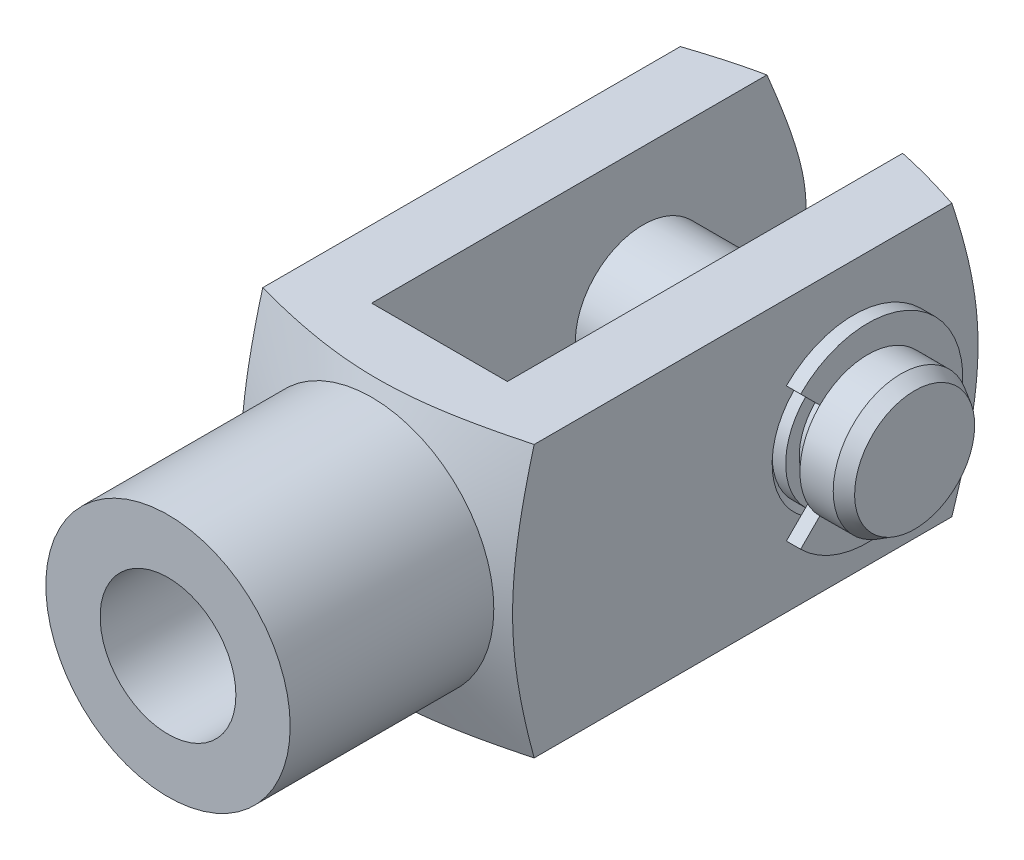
ISO-10303-21;
HEADER;
FILE_DESCRIPTION(('STEP AP214'),'2;1');
FILE_NAME('part.step','',(''),(''),'','','');
FILE_SCHEMA(('AUTOMOTIVE_DESIGN { 1 0 10303 214 1 1 1 1 }'));
ENDSEC;
DATA;
#1=APPLICATION_CONTEXT('core data for automotive mechanical design processes');
#2=APPLICATION_PROTOCOL_DEFINITION('international standard','automotive_design',2000,#1);
#3=PRODUCT_CONTEXT('',#1,'mechanical');
#4=PRODUCT('Part','Part','',(#3));
#5=PRODUCT_RELATED_PRODUCT_CATEGORY('part','',(#4));
#6=PRODUCT_DEFINITION_FORMATION('','',#4);
#7=PRODUCT_DEFINITION_CONTEXT('part definition',#1,'design');
#8=PRODUCT_DEFINITION('design','',#6,#7);
#9=PRODUCT_DEFINITION_SHAPE('','',#8);
#10=(LENGTH_UNIT() NAMED_UNIT(*) SI_UNIT(.MILLI.,.METRE.));
#11=(NAMED_UNIT(*) PLANE_ANGLE_UNIT() SI_UNIT($,.RADIAN.));
#12=(NAMED_UNIT(*) SI_UNIT($,.STERADIAN.) SOLID_ANGLE_UNIT());
#13=UNCERTAINTY_MEASURE_WITH_UNIT(LENGTH_MEASURE(1.E-05),#10,'distance_accuracy_value','');
#14=(GEOMETRIC_REPRESENTATION_CONTEXT(3) GLOBAL_UNCERTAINTY_ASSIGNED_CONTEXT((#13)) GLOBAL_UNIT_ASSIGNED_CONTEXT((#10,
#11,#12)) REPRESENTATION_CONTEXT('',''));
#15=CARTESIAN_POINT('',(0.,0.,0.));
#16=DIRECTION('',(0.,0.,1.));
#17=DIRECTION('',(1.,0.,0.));
#18=AXIS2_PLACEMENT_3D('',#15,#16,#17);
#19=CARTESIAN_POINT('',(11.55,0.,0.));
#20=DIRECTION('',(1.,0.,0.));
#21=DIRECTION('',(0.,-1.,0.));
#22=AXIS2_PLACEMENT_3D('',#19,#20,#21);
#23=PLANE('',#22);
#24=DIRECTION('',(0.,-0.707106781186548,-0.707106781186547));
#25=VECTOR('',#24,1.);
#26=CARTESIAN_POINT('',(11.55,8.48528137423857,8.4852813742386));
#27=LINE('',#26,#25);
#28=CARTESIAN_POINT('',(11.55,4.94974746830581,4.94974746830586));
#29=VERTEX_POINT('',#28);
#30=CARTESIAN_POINT('',(11.55,3.53553390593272,3.53553390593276));
#31=VERTEX_POINT('',#30);
#32=EDGE_CURVE('E174',#29,#31,#27,.T.);
#33=ORIENTED_EDGE('',*,*,#32,.T.);
#34=CARTESIAN_POINT('',(11.55,0.,0.));
#35=DIRECTION('',(1.,0.,0.));
#36=DIRECTION('',(0.,-1.,0.));
#37=AXIS2_PLACEMENT_3D('',#34,#35,#36);
#38=CIRCLE('',#37,5.);
#39=CARTESIAN_POINT('',(11.55,-3.53553390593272,3.53553390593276));
#40=VERTEX_POINT('',#39);
#41=EDGE_CURVE('E9',#31,#40,#38,.F.);
#42=ORIENTED_EDGE('',*,*,#41,.T.);
#43=DIRECTION('',(0.,-0.707106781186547,0.707106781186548));
#44=VECTOR('',#43,1.);
#45=CARTESIAN_POINT('',(11.55,-2.82842712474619,2.8284271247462));
#46=LINE('',#45,#44);
#47=CARTESIAN_POINT('',(11.55,-4.94974746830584,4.94974746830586));
#48=VERTEX_POINT('',#47);
#49=EDGE_CURVE('E181',#40,#48,#46,.T.);
#50=ORIENTED_EDGE('',*,*,#49,.T.);
#51=CARTESIAN_POINT('',(11.55,0.,0.));
#52=DIRECTION('',(-1.,0.,0.));
#53=DIRECTION('',(0.,1.,0.));
#54=AXIS2_PLACEMENT_3D('',#51,#52,#53);
#55=CIRCLE('',#54,7.);
#56=EDGE_CURVE('E178',#29,#48,#55,.T.);
#57=ORIENTED_EDGE('',*,*,#56,.F.);
#58=EDGE_LOOP('',(#33,#42,#50,#57));
#59=FACE_BOUND('',#58,.T.);
#60=ADVANCED_FACE('F15',(#59),#23,.T.);
#61=CARTESIAN_POINT('',(10.5,-2.82842712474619,2.8284271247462));
#62=DIRECTION('',(0.,-0.707106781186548,-0.707106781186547));
#63=DIRECTION('',(0.,-0.707106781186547,0.707106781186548));
#64=AXIS2_PLACEMENT_3D('',#61,#62,#63);
#65=PLANE('',#64);
#66=CARTESIAN_POINT('',(11.55,-2.82842712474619,2.8284271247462));
#67=VERTEX_POINT('',#66);
#68=EDGE_CURVE('E116',#67,#40,#46,.T.);
#69=ORIENTED_EDGE('',*,*,#68,.F.);
#70=DIRECTION('',(-1.,0.,0.));
#71=VECTOR('',#70,1.);
#72=CARTESIAN_POINT('',(10.5,-2.82842712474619,2.8284271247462));
#73=LINE('',#72,#71);
#74=CARTESIAN_POINT('',(10.5,-2.82842712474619,2.8284271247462));
#75=VERTEX_POINT('',#74);
#76=EDGE_CURVE('E179',#75,#67,#73,.F.);
#77=ORIENTED_EDGE('',*,*,#76,.F.);
#78=DIRECTION('',(0.,-0.707106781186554,0.707106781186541));
#79=VECTOR('',#78,1.);
#80=CARTESIAN_POINT('',(10.5,-2.82842712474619,2.8284271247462));
#81=LINE('',#80,#79);
#82=CARTESIAN_POINT('',(10.5,-3.53553390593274,3.53553390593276));
#83=VERTEX_POINT('',#82);
#84=EDGE_CURVE('E169',#75,#83,#81,.T.);
#85=ORIENTED_EDGE('',*,*,#84,.T.);
#86=CARTESIAN_POINT('',(10.5,-4.94974746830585,4.9497474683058));
#87=VERTEX_POINT('',#86);
#88=EDGE_CURVE('E151',#83,#87,#81,.T.);
#89=ORIENTED_EDGE('',*,*,#88,.T.);
#90=DIRECTION('',(-1.,0.,0.));
#91=VECTOR('',#90,1.);
#92=CARTESIAN_POINT('',(10.5,-4.94974746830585,4.9497474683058));
#93=LINE('',#92,#91);
#94=EDGE_CURVE('E175',#48,#87,#93,.T.);
#95=ORIENTED_EDGE('',*,*,#94,.F.);
#96=ORIENTED_EDGE('',*,*,#49,.F.);
#97=EDGE_LOOP('',(#69,#77,#85,#89,#95,#96));
#98=FACE_BOUND('',#97,.T.);
#99=ADVANCED_FACE('F423',(#98),#65,.F.);
#100=CARTESIAN_POINT('',(10.5,0.,0.));
#101=DIRECTION('',(-1.,0.,0.));
#102=DIRECTION('',(0.,1.,0.));
#103=AXIS2_PLACEMENT_3D('',#100,#101,#102);
#104=CYLINDRICAL_SURFACE('',#103,7.);
#105=DIRECTION('',(-1.,0.,0.));
#106=VECTOR('',#105,1.);
#107=CARTESIAN_POINT('',(10.5,4.94974746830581,4.94974746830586));
#108=LINE('',#107,#106);
#109=CARTESIAN_POINT('',(10.5,4.94974746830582,4.94974746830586));
#110=VERTEX_POINT('',#109);
#111=EDGE_CURVE('E167',#110,#29,#108,.F.);
#112=ORIENTED_EDGE('',*,*,#111,.T.);
#113=ORIENTED_EDGE('',*,*,#56,.T.);
#114=ORIENTED_EDGE('',*,*,#94,.T.);
#115=CARTESIAN_POINT('',(10.5,0.,0.));
#116=DIRECTION('',(-1.,0.,0.));
#117=DIRECTION('',(0.,1.,0.));
#118=AXIS2_PLACEMENT_3D('',#115,#116,#117);
#119=CIRCLE('',#118,7.);
#120=EDGE_CURVE('E161',#87,#110,#119,.F.);
#121=ORIENTED_EDGE('',*,*,#120,.T.);
#122=EDGE_LOOP('',(#112,#113,#114,#121));
#123=FACE_BOUND('',#122,.T.);
#124=ADVANCED_FACE('F428',(#123),#104,.T.);
#125=CARTESIAN_POINT('',(10.5,8.48528137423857,8.4852813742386));
#126=DIRECTION('',(0.,0.707106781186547,-0.707106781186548));
#127=DIRECTION('',(0.,-0.707106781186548,-0.707106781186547));
#128=AXIS2_PLACEMENT_3D('',#125,#126,#127);
#129=PLANE('',#128);
#130=DIRECTION('',(0.,-0.707106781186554,-0.707106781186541));
#131=VECTOR('',#130,1.);
#132=CARTESIAN_POINT('',(10.5,4.94974746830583,4.9497474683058));
#133=LINE('',#132,#131);
#134=CARTESIAN_POINT('',(10.5,3.53553390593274,3.53553390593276));
#135=VERTEX_POINT('',#134);
#136=EDGE_CURVE('E149',#110,#135,#133,.T.);
#137=ORIENTED_EDGE('',*,*,#136,.T.);
#138=CARTESIAN_POINT('',(10.5,2.82842712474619,2.8284271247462));
#139=VERTEX_POINT('',#138);
#140=EDGE_CURVE('E155',#135,#139,#133,.T.);
#141=ORIENTED_EDGE('',*,*,#140,.T.);
#142=DIRECTION('',(-1.,0.,0.));
#143=VECTOR('',#142,1.);
#144=CARTESIAN_POINT('',(10.5,2.82842712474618,2.8284271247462));
#145=LINE('',#144,#143);
#146=CARTESIAN_POINT('',(11.55,2.82842712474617,2.8284271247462));
#147=VERTEX_POINT('',#146);
#148=EDGE_CURVE('E172',#147,#139,#145,.T.);
#149=ORIENTED_EDGE('',*,*,#148,.F.);
#150=EDGE_CURVE('E184',#31,#147,#27,.T.);
#151=ORIENTED_EDGE('',*,*,#150,.F.);
#152=ORIENTED_EDGE('',*,*,#32,.F.);
#153=ORIENTED_EDGE('',*,*,#111,.F.);
#154=EDGE_LOOP('',(#137,#141,#149,#151,#152,#153));
#155=FACE_BOUND('',#154,.T.);
#156=ADVANCED_FACE('F164',(#155),#129,.F.);
#157=CARTESIAN_POINT('',(10.5,0.,0.));
#158=DIRECTION('',(1.,0.,0.));
#159=DIRECTION('',(0.,-1.,0.));
#160=AXIS2_PLACEMENT_3D('',#157,#158,#159);
#161=PLANE('',#160);
#162=CARTESIAN_POINT('',(10.5,0.,0.));
#163=DIRECTION('',(1.,0.,0.));
#164=DIRECTION('',(0.,0.,-1.));
#165=AXIS2_PLACEMENT_3D('',#162,#163,#164);
#166=CIRCLE('',#165,5.);
#167=EDGE_CURVE('E25',#83,#135,#166,.T.);
#168=ORIENTED_EDGE('',*,*,#167,.T.);
#169=ORIENTED_EDGE('',*,*,#136,.F.);
#170=ORIENTED_EDGE('',*,*,#120,.F.);
#171=ORIENTED_EDGE('',*,*,#88,.F.);
#172=EDGE_LOOP('',(#168,#169,#170,#171));
#173=FACE_BOUND('',#172,.T.);
#174=ADVANCED_FACE('F146',(#173),#161,.F.);
#175=CARTESIAN_POINT('',(-12.,0.,3.));
#176=DIRECTION('',(-1.,0.,0.));
#177=DIRECTION('',(0.,1.,0.));
#178=AXIS2_PLACEMENT_3D('',#175,#176,#177);
#179=PLANE('',#178);
#180=CARTESIAN_POINT('',(-12.0000000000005,0.,0.));
#181=DIRECTION('',(1.,0.,0.));
#182=DIRECTION('',(0.,-1.,0.));
#183=AXIS2_PLACEMENT_3D('',#180,#181,#182);
#184=CIRCLE('',#183,5.99999999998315);
#185=CARTESIAN_POINT('',(-12.0000000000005,-5.99999999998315,0.));
#186=VERTEX_POINT('',#185);
#187=EDGE_CURVE('E735',#186,#186,#184,.T.);
#188=ORIENTED_EDGE('',*,*,#187,.F.);
#189=EDGE_LOOP('',(#188));
#190=FACE_BOUND('',#189,.T.);
#191=ADVANCED_FACE('F407',(#190),#179,.T.);
#192=CARTESIAN_POINT('',(-10.9999999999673,0.,0.));
#193=DIRECTION('',(1.,0.,0.));
#194=DIRECTION('',(0.,-1.,0.));
#195=AXIS2_PLACEMENT_3D('',#192,#193,#194);
#196=CONICAL_SURFACE('',#195,6.99999999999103,0.785398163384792);
#197=ORIENTED_EDGE('',*,*,#187,.T.);
#198=EDGE_LOOP('',(#197));
#199=FACE_BOUND('',#198,.T.);
#200=CARTESIAN_POINT('',(-11.,0.,0.));
#201=DIRECTION('',(1.,0.,0.));
#202=DIRECTION('',(0.,-1.,0.));
#203=AXIS2_PLACEMENT_3D('',#200,#201,#202);
#204=CIRCLE('',#203,7.);
#205=CARTESIAN_POINT('',(-11.,-7.,0.));
#206=VERTEX_POINT('',#205);
#207=EDGE_CURVE('E374',#206,#206,#204,.T.);
#208=ORIENTED_EDGE('',*,*,#207,.F.);
#209=EDGE_LOOP('',(#208));
#210=FACE_BOUND('',#209,.T.);
#211=ADVANCED_FACE('F400',(#199,#210),#196,.T.);
#212=CARTESIAN_POINT('',(0.,4.5,40.));
#213=DIRECTION('',(0.,0.,1.));
#214=DIRECTION('',(1.,0.,0.));
#215=AXIS2_PLACEMENT_3D('',#212,#213,#214);
#216=PLANE('',#215);
#217=CARTESIAN_POINT('',(0.,0.,40.));
#218=DIRECTION('',(0.,0.,1.));
#219=DIRECTION('',(1.,0.,0.));
#220=AXIS2_PLACEMENT_3D('',#217,#218,#219);
#221=CIRCLE('',#220,9.);
#222=CARTESIAN_POINT('',(9.,0.,40.));
#223=VERTEX_POINT('',#222);
#224=EDGE_CURVE('E365',#223,#223,#221,.F.);
#225=ORIENTED_EDGE('',*,*,#224,.F.);
#226=EDGE_LOOP('',(#225));
#227=FACE_BOUND('',#226,.T.);
#228=CARTESIAN_POINT('',(0.,0.,40.0000000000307));
#229=DIRECTION('',(0.,0.,1.));
#230=DIRECTION('',(1.,0.,0.));
#231=AXIS2_PLACEMENT_3D('',#228,#229,#230);
#232=CIRCLE('',#231,5.00000000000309);
#233=CARTESIAN_POINT('',(5.00000000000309,0.,40.0000000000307));
#234=VERTEX_POINT('',#233);
#235=EDGE_CURVE('E141',#234,#234,#232,.F.);
#236=ORIENTED_EDGE('',*,*,#235,.T.);
#237=EDGE_LOOP('',(#236));
#238=FACE_BOUND('',#237,.T.);
#239=ADVANCED_FACE('F398',(#227,#238),#216,.T.);
#240=CARTESIAN_POINT('',(-10.5,0.,0.));
#241=DIRECTION('',(1.,0.,0.));
#242=DIRECTION('',(0.,-1.,0.));
#243=AXIS2_PLACEMENT_3D('',#240,#241,#242);
#244=CYLINDRICAL_SURFACE('',#243,7.);
#245=ORIENTED_EDGE('',*,*,#207,.T.);
#246=EDGE_LOOP('',(#245));
#247=FACE_BOUND('',#246,.T.);
#248=CARTESIAN_POINT('',(-10.,0.,0.));
#249=DIRECTION('',(1.,0.,0.));
#250=DIRECTION('',(0.,-1.,0.));
#251=AXIS2_PLACEMENT_3D('',#248,#249,#250);
#252=CIRCLE('',#251,7.);
#253=CARTESIAN_POINT('',(-10.,-7.,0.));
#254=VERTEX_POINT('',#253);
#255=EDGE_CURVE('E182',#254,#254,#252,.T.);
#256=ORIENTED_EDGE('',*,*,#255,.F.);
#257=EDGE_LOOP('',(#256));
#258=FACE_BOUND('',#257,.T.);
#259=ADVANCED_FACE('F394',(#247,#258),#244,.T.);
#260=CARTESIAN_POINT('',(0.,0.,5.85786437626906));
#261=DIRECTION('',(0.,0.,1.));
#262=DIRECTION('',(1.,0.,0.));
#263=AXIS2_PLACEMENT_3D('',#260,#261,#262);
#264=CYLINDRICAL_SURFACE('',#263,5.);
#265=CARTESIAN_POINT('',(0.,0.,20.0000000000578));
#266=DIRECTION('',(0.,0.,-1.));
#267=DIRECTION('',(-1.,0.,0.));
#268=AXIS2_PLACEMENT_3D('',#265,#266,#267);
#269=CIRCLE('',#268,4.99999999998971);
#270=CARTESIAN_POINT('',(-5.,0.,20.));
#271=VERTEX_POINT('',#270);
#272=CARTESIAN_POINT('',(4.99999999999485,0.,20.0000000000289));
#273=VERTEX_POINT('',#272);
#274=EDGE_CURVE('E253',#271,#273,#269,.T.);
#275=ORIENTED_EDGE('',*,*,#274,.T.);
#276=CARTESIAN_POINT('',(0.,0.,20.0000000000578));
#277=DIRECTION('',(0.,0.,-1.));
#278=DIRECTION('',(-1.,0.,0.));
#279=AXIS2_PLACEMENT_3D('',#276,#277,#278);
#280=CIRCLE('',#279,4.99999999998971);
#281=EDGE_CURVE('E233',#273,#271,#280,.T.);
#282=ORIENTED_EDGE('',*,*,#281,.T.);
#283=EDGE_LOOP('',(#275,#282));
#284=FACE_BOUND('',#283,.T.);
#285=ORIENTED_EDGE('',*,*,#235,.F.);
#286=EDGE_LOOP('',(#285));
#287=FACE_BOUND('',#286,.T.);
#288=ADVANCED_FACE('F397',(#284,#287),#264,.F.);
#289=CARTESIAN_POINT('',(0.5,0.,0.));
#290=DIRECTION('',(1.,0.,0.));
#291=DIRECTION('',(0.,-1.,0.));
#292=AXIS2_PLACEMENT_3D('',#289,#290,#291);
#293=CYLINDRICAL_SURFACE('',#292,5.);
#294=CARTESIAN_POINT('',(-5.,0.,0.));
#295=DIRECTION('',(1.,0.,0.));
#296=DIRECTION('',(0.,-1.,0.));
#297=AXIS2_PLACEMENT_3D('',#294,#295,#296);
#298=CIRCLE('',#297,5.);
#299=CARTESIAN_POINT('',(-5.,-5.,0.));
#300=VERTEX_POINT('',#299);
#301=EDGE_CURVE('E227',#300,#300,#298,.T.);
#302=ORIENTED_EDGE('',*,*,#301,.T.);
#303=EDGE_LOOP('',(#302));
#304=FACE_BOUND('',#303,.T.);
#305=CARTESIAN_POINT('',(5.,0.,0.));
#306=DIRECTION('',(1.,0.,0.));
#307=DIRECTION('',(0.,-1.,0.));
#308=AXIS2_PLACEMENT_3D('',#305,#306,#307);
#309=CIRCLE('',#308,5.);
#310=CARTESIAN_POINT('',(5.,-5.,0.));
#311=VERTEX_POINT('',#310);
#312=EDGE_CURVE('E361',#311,#311,#309,.F.);
#313=ORIENTED_EDGE('',*,*,#312,.T.);
#314=EDGE_LOOP('',(#313));
#315=FACE_BOUND('',#314,.T.);
#316=ADVANCED_FACE('F413',(#304,#315),#293,.T.);
#317=CARTESIAN_POINT('',(-5.,36.,20.));
#318=DIRECTION('',(0.,0.,1.));
#319=DIRECTION('',(1.,0.,0.));
#320=AXIS2_PLACEMENT_3D('',#317,#318,#319);
#321=PLANE('',#320);
#322=ORIENTED_EDGE('',*,*,#281,.F.);
#323=DIRECTION('',(0.,1.,0.));
#324=VECTOR('',#323,1.);
#325=CARTESIAN_POINT('',(5.,36.,20.));
#326=LINE('',#325,#324);
#327=CARTESIAN_POINT('',(5.,-10.,20.));
#328=VERTEX_POINT('',#327);
#329=EDGE_CURVE('E230',#328,#273,#326,.T.);
#330=ORIENTED_EDGE('',*,*,#329,.F.);
#331=DIRECTION('',(1.,0.,0.));
#332=VECTOR('',#331,1.);
#333=CARTESIAN_POINT('',(-36.,-10.,20.));
#334=LINE('',#333,#332);
#335=CARTESIAN_POINT('',(-5.,-10.,20.));
#336=VERTEX_POINT('',#335);
#337=EDGE_CURVE('E205',#328,#336,#334,.F.);
#338=ORIENTED_EDGE('',*,*,#337,.T.);
#339=DIRECTION('',(0.,1.,0.));
#340=VECTOR('',#339,1.);
#341=CARTESIAN_POINT('',(-5.,36.,20.));
#342=LINE('',#341,#340);
#343=EDGE_CURVE('E223',#336,#271,#342,.T.);
#344=ORIENTED_EDGE('',*,*,#343,.T.);
#345=EDGE_LOOP('',(#322,#330,#338,#344));
#346=FACE_BOUND('',#345,.T.);
#347=ADVANCED_FACE('F346',(#346),#321,.F.);
#348=CARTESIAN_POINT('',(0.,0.,32.5));
#349=DIRECTION('',(0.,0.,1.));
#350=DIRECTION('',(1.,0.,0.));
#351=AXIS2_PLACEMENT_3D('',#348,#349,#350);
#352=CYLINDRICAL_SURFACE('',#351,9.);
#353=CARTESIAN_POINT('',(0.,0.,25.));
#354=DIRECTION('',(0.,0.,-1.));
#355=DIRECTION('',(0.,1.,0.));
#356=AXIS2_PLACEMENT_3D('',#353,#354,#355);
#357=CIRCLE('',#356,9.);
#358=CARTESIAN_POINT('',(0.,9.00000000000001,25.));
#359=VERTEX_POINT('',#358);
#360=EDGE_CURVE('E235',#359,#359,#357,.T.);
#361=ORIENTED_EDGE('',*,*,#360,.F.);
#362=EDGE_LOOP('',(#361));
#363=FACE_BOUND('',#362,.T.);
#364=ORIENTED_EDGE('',*,*,#224,.T.);
#365=EDGE_LOOP('',(#364));
#366=FACE_BOUND('',#365,.T.);
#367=ADVANCED_FACE('F433',(#363,#366),#352,.T.);
#368=CARTESIAN_POINT('',(-10.,36.,60.));
#369=DIRECTION('',(1.,0.,0.));
#370=DIRECTION('',(0.,-1.,0.));
#371=AXIS2_PLACEMENT_3D('',#368,#369,#370);
#372=PLANE('',#371);
#373=ORIENTED_EDGE('',*,*,#255,.T.);
#374=EDGE_LOOP('',(#373));
#375=FACE_BOUND('',#374,.T.);
#376=CARTESIAN_POINT('',(-9.99999996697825,9.99999998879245,23.0261190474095));
#377=CARTESIAN_POINT('',(-9.99999998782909,9.76124311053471,23.0909210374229));
#378=CARTESIAN_POINT('',(-9.99999999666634,9.52219551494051,23.1546510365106));
#379=CARTESIAN_POINT('',(-10.0000000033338,9.04345490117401,23.2796791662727));
#380=CARTESIAN_POINT('',(-10.0000000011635,8.80376185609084,23.34097719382));
#381=CARTESIAN_POINT('',(-9.99999999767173,8.0833982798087,23.5208459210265));
#382=CARTESIAN_POINT('',(-9.99999999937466,7.60169252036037,23.6353229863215));
#383=CARTESIAN_POINT('',(-10.0000000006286,6.63262541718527,23.8510454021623));
#384=CARTESIAN_POINT('',(-10.0000000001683,6.14524763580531,23.9522175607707));
#385=CARTESIAN_POINT('',(-9.99999999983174,5.16720650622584,24.1370481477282));
#386=CARTESIAN_POINT('',(-9.99999999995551,4.67654363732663,24.2207090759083));
#387=CARTESIAN_POINT('',(-10.0000000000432,3.70570081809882,24.3645517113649));
#388=CARTESIAN_POINT('',(-10.0000000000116,3.22560955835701,24.4253225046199));
#389=CARTESIAN_POINT('',(-9.99999999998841,2.26297611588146,24.5231031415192));
#390=CARTESIAN_POINT('',(-9.9999999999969,1.78043400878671,24.5601137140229));
#391=CARTESIAN_POINT('',(-10.0000000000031,0.815299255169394,24.6077679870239));
#392=CARTESIAN_POINT('',(-10.0000000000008,0.332710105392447,24.618481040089));
#393=CARTESIAN_POINT('',(-9.99999999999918,-0.632303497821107,24.6129295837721));
#394=CARTESIAN_POINT('',(-9.99999999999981,-1.11472795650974,24.5966660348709));
#395=CARTESIAN_POINT('',(-10.0000000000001,-1.94841291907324,24.5462368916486));
#396=CARTESIAN_POINT('',(-10.,-2.30005450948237,24.5180624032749));
#397=CARTESIAN_POINT('',(-9.99999999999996,-3.00206553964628,24.4490058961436));
#398=CARTESIAN_POINT('',(-9.99999999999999,-3.35243503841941,24.4081244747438));
#399=CARTESIAN_POINT('',(-10.,-4.05223869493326,24.3148655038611));
#400=CARTESIAN_POINT('',(-10.,-4.40167019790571,24.2624682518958));
#401=CARTESIAN_POINT('',(-9.99999999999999,-5.09887023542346,24.147635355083));
#402=CARTESIAN_POINT('',(-10.,-5.44663875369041,24.0851996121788));
#403=CARTESIAN_POINT('',(-10.,-6.1479458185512,23.9502471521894));
#404=CARTESIAN_POINT('',(-10.,-6.50144802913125,23.877542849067));
#405=CARTESIAN_POINT('',(-10.,-7.20679295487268,23.7244675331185));
#406=CARTESIAN_POINT('',(-10.,-7.55863560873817,23.6440962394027));
#407=CARTESIAN_POINT('',(-10.,-8.25955356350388,23.4771861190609));
#408=CARTESIAN_POINT('',(-10.,-8.60863423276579,23.3906697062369));
#409=CARTESIAN_POINT('',(-10.,-9.30535013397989,23.2122169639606));
#410=CARTESIAN_POINT('',(-10.,-9.65298558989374,23.1202815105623));
#411=CARTESIAN_POINT('',(-10.,-10.,23.0261190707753));
#412=B_SPLINE_CURVE_WITH_KNOTS('',3,(#376,#377,#378,#379,#380,#381,#382,#383,#384,#385,#386,
#387,#388,#389,#390,#391,#392,#393,#394,#395,#396,#397,#398,#399,#400,#401,#402,#403,#404,#405,
#406,#407,#408,#409,#410,#411),.UNSPECIFIED.,.F.,.F.,(4,2,2,2,2,2,2,2,2,2,2,2,2,2,2,2,2,4),(0.,
0.742179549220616,1.484390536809,2.96958754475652,4.46264048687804,5.95548014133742,
7.40673794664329,8.85795123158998,10.3053332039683,11.7526636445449,12.8107377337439,
13.8687620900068,14.9286109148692,15.9884700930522,17.0710741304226,18.1537178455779,
19.2325975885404,20.3113033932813),.UNSPECIFIED.);
#413=CARTESIAN_POINT('',(-9.99999996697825,9.99999999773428,23.0261190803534));
#414=VERTEX_POINT('',#413);
#415=CARTESIAN_POINT('',(-10.,-10.,23.0261190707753));
#416=VERTEX_POINT('',#415);
#417=EDGE_CURVE('E192',#414,#416,#412,.T.);
#418=ORIENTED_EDGE('',*,*,#417,.F.);
#419=DIRECTION('',(0.,0.,-1.));
#420=VECTOR('',#419,1.);
#421=CARTESIAN_POINT('',(-10.,10.,60.));
#422=LINE('',#421,#420);
#423=CARTESIAN_POINT('',(-10.,10.,-7.7369521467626));
#424=VERTEX_POINT('',#423);
#425=EDGE_CURVE('E193',#424,#414,#422,.F.);
#426=ORIENTED_EDGE('',*,*,#425,.F.);
#427=CARTESIAN_POINT('',(-10.,-10.,-7.7369521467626));
#428=CARTESIAN_POINT('',(-10.,-9.80129290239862,-7.80246889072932));
#429=CARTESIAN_POINT('',(-10.,-9.60229750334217,-7.86711026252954));
#430=CARTESIAN_POINT('',(-10.,-9.20367719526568,-7.99444362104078));
#431=CARTESIAN_POINT('',(-10.,-9.00405226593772,-8.05713554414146));
#432=CARTESIAN_POINT('',(-10.,-8.40402041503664,-8.24202993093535));
#433=CARTESIAN_POINT('',(-10.,-8.00260826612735,-8.36100061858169));
#434=CARTESIAN_POINT('',(-10.,-7.19393105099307,-8.5891664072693));
#435=CARTESIAN_POINT('',(-10.,-6.78664466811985,-8.6982863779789));
#436=CARTESIAN_POINT('',(-10.,-5.96878316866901,-8.90335784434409));
#437=CARTESIAN_POINT('',(-10.,-5.55820838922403,-8.99931067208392));
#438=CARTESIAN_POINT('',(-10.,-4.74810932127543,-9.17215434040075));
#439=CARTESIAN_POINT('',(-10.,-4.34870384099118,-9.24959662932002));
#440=CARTESIAN_POINT('',(-10.,-3.54684468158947,-9.38689275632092));
#441=CARTESIAN_POINT('',(-10.,-3.14439102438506,-9.44674672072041));
#442=CARTESIAN_POINT('',(-10.,-2.33835629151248,-9.54608806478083));
#443=CARTESIAN_POINT('',(-9.99999999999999,-1.93478396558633,-9.58564535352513));
#444=CARTESIAN_POINT('',(-10.,-1.12607075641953,-9.64269126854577));
#445=CARTESIAN_POINT('',(-10.,-0.720929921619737,-9.660180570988));
#446=CARTESIAN_POINT('',(-10.,0.11503345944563,-9.67247145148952));
#447=CARTESIAN_POINT('',(-10.,0.545878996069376,-9.66578719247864));
#448=CARTESIAN_POINT('',(-9.99999999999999,1.40640737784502,-9.62680918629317));
#449=CARTESIAN_POINT('',(-10.,1.83609015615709,-9.5945139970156));
#450=CARTESIAN_POINT('',(-10.,2.69458757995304,-9.50610526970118));
#451=CARTESIAN_POINT('',(-10.,3.1233928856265,-9.44990262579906));
#452=CARTESIAN_POINT('',(-10.,3.97770123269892,-9.31661877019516));
#453=CARTESIAN_POINT('',(-10.,4.40320421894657,-9.23953721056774));
#454=CARTESIAN_POINT('',(-10.,5.26691725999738,-9.06446436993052));
#455=CARTESIAN_POINT('',(-10.,5.70498562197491,-8.96578215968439));
#456=CARTESIAN_POINT('',(-10.,6.57735469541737,-8.75290483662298));
#457=CARTESIAN_POINT('',(-10.,7.01165491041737,-8.63870771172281));
#458=CARTESIAN_POINT('',(-10.,7.87346393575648,-8.39874046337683));
#459=CARTESIAN_POINT('',(-10.,8.30099927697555,-8.27306498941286));
#460=CARTESIAN_POINT('',(-10.,8.93990108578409,-8.07716925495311));
#461=CARTESIAN_POINT('',(-10.,9.15241653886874,-8.01065740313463));
#462=CARTESIAN_POINT('',(-10.,9.57673007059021,-7.87541122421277));
#463=CARTESIAN_POINT('',(-10.,9.78852817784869,-7.80667698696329));
#464=CARTESIAN_POINT('',(-10.,10.,-7.7369521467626));
#465=B_SPLINE_CURVE_WITH_KNOTS('',3,(#427,#428,#429,#430,#431,#432,#433,#434,#435,#436,#437,
#438,#439,#440,#441,#442,#443,#444,#445,#446,#447,#448,#449,#450,#451,#452,#453,#454,#455,#456,
#457,#458,#459,#460,#461,#462,#463,#464),.UNSPECIFIED.,.F.,.F.,(4,2,2,2,2,2,2,2,2,2,2,2,2,2,2,2,
2,2,4),(0.,0.627684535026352,1.25538952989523,2.51127936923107,3.77605604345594,
5.04070466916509,6.26090383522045,7.48109423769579,8.69705316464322,9.91297483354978,
11.2048689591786,12.496835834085,13.7936608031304,15.090507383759,16.4372963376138,
17.7842601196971,19.1209769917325,19.7890091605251,20.457014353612),.UNSPECIFIED.);
#466=CARTESIAN_POINT('',(-10.,-10.,-7.7369521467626));
#467=VERTEX_POINT('',#466);
#468=EDGE_CURVE('E196',#467,#424,#465,.T.);
#469=ORIENTED_EDGE('',*,*,#468,.F.);
#470=DIRECTION('',(0.,0.,-1.));
#471=VECTOR('',#470,1.);
#472=CARTESIAN_POINT('',(-10.,-10.,60.));
#473=LINE('',#472,#471);
#474=EDGE_CURVE('E189',#416,#467,#473,.T.);
#475=ORIENTED_EDGE('',*,*,#474,.F.);
#476=EDGE_LOOP('',(#418,#426,#469,#475));
#477=FACE_BOUND('',#476,.T.);
#478=ADVANCED_FACE('F268',(#375,#477),#372,.F.);
#479=CARTESIAN_POINT('',(0.,0.,-7.7113738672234));
#480=DIRECTION('',(0.,0.,1.));
#481=DIRECTION('',(1.,0.,0.));
#482=AXIS2_PLACEMENT_3D('',#479,#480,#481);
#483=CONICAL_SURFACE('',#482,14.1969884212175,1.13446401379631);
#484=CARTESIAN_POINT('',(-10.,10.,-7.7369521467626));
#485=CARTESIAN_POINT('',(-9.79457944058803,10.,-7.80468210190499));
#486=CARTESIAN_POINT('',(-9.58885044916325,10.,-7.8714771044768));
#487=CARTESIAN_POINT('',(-9.17671906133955,10.,-8.00297614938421));
#488=CARTESIAN_POINT('',(-8.97031664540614,10.,-8.06768013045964));
#489=CARTESIAN_POINT('',(-8.35036739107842,10.,-8.25821514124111));
#490=CARTESIAN_POINT('',(-7.93574598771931,10.,-8.3805796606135));
#491=CARTESIAN_POINT('',(-7.10316019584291,10.,-8.6139110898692));
#492=CARTESIAN_POINT('',(-6.68519495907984,10.,-8.72487500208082));
#493=CARTESIAN_POINT('',(-6.05546745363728,10.,-8.88078147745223));
#494=CARTESIAN_POINT('',(-5.84501119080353,10.,-8.93101152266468));
#495=CARTESIAN_POINT('',(-5.42318933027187,10.,-9.0275632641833));
#496=CARTESIAN_POINT('',(-5.21182366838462,10.,-9.07388467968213));
#497=CARTESIAN_POINT('',(-5.,10.,-9.1180601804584));
#498=B_SPLINE_CURVE_WITH_KNOTS('',3,(#484,#485,#486,#487,#488,#489,#490,#491,#492,#493,#494,
#495,#496,#497),.UNSPECIFIED.,.F.,.F.,(4,2,2,2,2,2,4),(0.,0.648891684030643,1.29780236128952,
2.59457270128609,3.89168314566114,4.54075218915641,5.18986782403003),.UNSPECIFIED.);
#499=CARTESIAN_POINT('',(-5.,10.,-9.1180601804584));
#500=VERTEX_POINT('',#499);
#501=EDGE_CURVE('E222',#424,#500,#498,.T.);
#502=ORIENTED_EDGE('',*,*,#501,.T.);
#503=CARTESIAN_POINT('',(-5.,10.,-9.1180601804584));
#504=CARTESIAN_POINT('',(-5.,9.70595246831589,-9.24066774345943));
#505=CARTESIAN_POINT('',(-5.,9.41153849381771,-9.36240990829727));
#506=CARTESIAN_POINT('',(-5.,8.8217282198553,-9.60357479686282));
#507=CARTESIAN_POINT('',(-5.,8.52633182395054,-9.72299728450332));
#508=CARTESIAN_POINT('',(-5.,7.93324860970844,-9.95935469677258));
#509=CARTESIAN_POINT('',(-5.,7.63555735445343,-10.0762785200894));
#510=CARTESIAN_POINT('',(-5.,7.03869888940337,-10.3062743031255));
#511=CARTESIAN_POINT('',(-5.,6.73953173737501,-10.4193464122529));
#512=CARTESIAN_POINT('',(-5.,6.13924095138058,-10.6404442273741));
#513=CARTESIAN_POINT('',(-5.,5.83811682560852,-10.7484686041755));
#514=CARTESIAN_POINT('',(-5.,5.2334598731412,-10.9577132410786));
#515=CARTESIAN_POINT('',(-5.,4.92992679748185,-11.0589327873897));
#516=CARTESIAN_POINT('',(-5.,4.32025969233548,-11.2519799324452));
#517=CARTESIAN_POINT('',(-5.,4.01412916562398,-11.3438185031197));
#518=CARTESIAN_POINT('',(-5.,3.398348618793,-11.5148078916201));
#519=CARTESIAN_POINT('',(-5.,3.08869952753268,-11.5939619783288));
#520=CARTESIAN_POINT('',(-5.,2.608599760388,-11.7026560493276));
#521=CARTESIAN_POINT('',(-5.,2.43952776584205,-11.7382873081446));
#522=CARTESIAN_POINT('',(-5.,2.10024416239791,-11.8036880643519));
#523=CARTESIAN_POINT('',(-5.,1.93003256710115,-11.8334576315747));
#524=CARTESIAN_POINT('',(-5.,1.5886504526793,-11.8862930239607));
#525=CARTESIAN_POINT('',(-5.,1.41748046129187,-11.9093622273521));
#526=CARTESIAN_POINT('',(-5.,1.07430310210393,-11.9480528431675));
#527=CARTESIAN_POINT('',(-5.,0.902295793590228,-11.9636747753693));
#528=CARTESIAN_POINT('',(-5.,0.558024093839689,-11.986866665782));
#529=CARTESIAN_POINT('',(-5.,0.385760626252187,-11.9944501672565));
#530=CARTESIAN_POINT('',(-5.,0.0410669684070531,-12.0013041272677));
#531=CARTESIAN_POINT('',(-5.,-0.131363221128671,-12.0005746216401));
#532=CARTESIAN_POINT('',(-5.,-0.475971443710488,-11.9908332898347));
#533=CARTESIAN_POINT('',(-5.,-0.648149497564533,-11.9818221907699));
#534=CARTESIAN_POINT('',(-5.,-0.991900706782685,-11.955881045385));
#535=CARTESIAN_POINT('',(-5.,-1.16347385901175,-11.9389509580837));
#536=CARTESIAN_POINT('',(-5.,-1.52041761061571,-11.8960266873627));
#537=CARTESIAN_POINT('',(-5.,-1.70570906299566,-11.8693794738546));
#538=CARTESIAN_POINT('',(-5.,-2.07505116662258,-11.8084746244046));
#539=CARTESIAN_POINT('',(-5.,-2.259101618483,-11.7742157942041));
#540=CARTESIAN_POINT('',(-5.,-2.62598013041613,-11.6991262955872));
#541=CARTESIAN_POINT('',(-5.,-2.80880723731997,-11.6582910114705));
#542=CARTESIAN_POINT('',(-5.,-3.17311841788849,-11.5710819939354));
#543=CARTESIAN_POINT('',(-5.,-3.35460254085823,-11.5247084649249));
#544=CARTESIAN_POINT('',(-5.,-3.71730200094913,-11.4270637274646));
#545=CARTESIAN_POINT('',(-5.,-3.89851048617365,-11.3757672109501));
#546=CARTESIAN_POINT('',(-5.,-4.25978069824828,-11.2692713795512));
#547=CARTESIAN_POINT('',(-5.,-4.43984236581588,-11.2140718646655));
#548=CARTESIAN_POINT('',(-5.,-4.97835718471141,-11.0436818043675));
#549=CARTESIAN_POINT('',(-5.,-5.33528065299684,-10.9236607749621));
#550=CARTESIAN_POINT('',(-5.,-6.0568987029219,-10.6708667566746));
#551=CARTESIAN_POINT('',(-5.,-6.42149424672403,-10.5378149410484));
#552=CARTESIAN_POINT('',(-5.,-7.14819907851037,-10.2650159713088));
#553=CARTESIAN_POINT('',(-5.,-7.51030813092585,-10.1252681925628));
#554=CARTESIAN_POINT('',(-5.,-8.22783886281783,-9.8428363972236));
#555=CARTESIAN_POINT('',(-5.,-8.58328559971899,-9.70021576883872));
#556=CARTESIAN_POINT('',(-5.,-9.11534613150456,-9.48368556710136));
#557=CARTESIAN_POINT('',(-5.,-9.29249434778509,-9.41108414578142));
#558=CARTESIAN_POINT('',(-5.,-9.64647402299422,-9.26511796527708));
#559=CARTESIAN_POINT('',(-5.,-9.82330548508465,-9.19175321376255));
#560=CARTESIAN_POINT('',(-5.,-10.,-9.1180601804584));
#561=B_SPLINE_CURVE_WITH_KNOTS('',3,(#503,#504,#505,#506,#507,#508,#509,#510,#511,#512,#513,
#514,#515,#516,#517,#518,#519,#520,#521,#522,#523,#524,#525,#526,#527,#528,#529,#530,#531,#532,
#533,#534,#535,#536,#537,#538,#539,#540,#541,#542,#543,#544,#545,#546,#547,#548,#549,#550,#551,
#552,#553,#554,#555,#556,#557,#558,#559,#560),.UNSPECIFIED.,.F.,.F.,(4,2,2,2,2,2,2,2,2,2,2,2,2,
2,2,2,2,2,2,2,2,2,2,2,2,2,2,2,4),(0.,0.95576214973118,1.91162106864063,2.87109086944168,
3.83052340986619,4.79020718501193,5.74999146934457,6.70864002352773,7.66704112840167,
8.18531441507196,8.70358152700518,9.22158688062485,9.73955607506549,10.2566511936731,
10.7737440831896,11.2907915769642,11.8078417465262,12.3692517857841,12.9307499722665,
13.4926439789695,14.0545172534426,14.6194518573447,15.1844154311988,16.3139054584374,
17.4781675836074,18.6425385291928,19.7914905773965,20.3658341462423,20.9401719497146),.UNSPECIFIED.);
#562=CARTESIAN_POINT('',(-5.,-10.,-9.1180601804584));
#563=VERTEX_POINT('',#562);
#564=EDGE_CURVE('E248',#500,#563,#561,.T.);
#565=ORIENTED_EDGE('',*,*,#564,.T.);
#566=CARTESIAN_POINT('',(-5.,-10.,-9.1180601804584));
#567=CARTESIAN_POINT('',(-5.21182366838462,-10.,-9.07388467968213));
#568=CARTESIAN_POINT('',(-5.42318933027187,-10.,-9.02756326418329));
#569=CARTESIAN_POINT('',(-5.84501119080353,-10.,-8.93101152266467));
#570=CARTESIAN_POINT('',(-6.05546745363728,-10.,-8.88078147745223));
#571=CARTESIAN_POINT('',(-6.68519495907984,-10.,-8.72487500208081));
#572=CARTESIAN_POINT('',(-7.10316019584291,-10.,-8.61391108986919));
#573=CARTESIAN_POINT('',(-7.93574598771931,-10.,-8.3805796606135));
#574=CARTESIAN_POINT('',(-8.35036739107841,-10.,-8.2582151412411));
#575=CARTESIAN_POINT('',(-8.97031664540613,-10.,-8.06768013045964));
#576=CARTESIAN_POINT('',(-9.17671906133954,-10.,-8.00297614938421));
#577=CARTESIAN_POINT('',(-9.58885044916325,-10.,-7.87147710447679));
#578=CARTESIAN_POINT('',(-9.79457944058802,-10.,-7.80468210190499));
#579=CARTESIAN_POINT('',(-10.,-10.,-7.7369521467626));
#580=B_SPLINE_CURVE_WITH_KNOTS('',3,(#566,#567,#568,#569,#570,#571,#572,#573,#574,#575,#576,
#577,#578,#579),.UNSPECIFIED.,.F.,.F.,(4,2,2,2,2,2,4),(0.,0.649115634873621,1.29818467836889,
2.59529512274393,3.8920654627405,4.54097613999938,5.18986782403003),.UNSPECIFIED.);
#581=EDGE_CURVE('E204',#563,#467,#580,.T.);
#582=ORIENTED_EDGE('',*,*,#581,.T.);
#583=ORIENTED_EDGE('',*,*,#468,.T.);
#584=EDGE_LOOP('',(#502,#565,#582,#583));
#585=FACE_BOUND('',#584,.T.);
#586=ADVANCED_FACE('F321',(#585),#483,.T.);
#587=CARTESIAN_POINT('',(-5.,36.,-38.));
#588=DIRECTION('',(-1.,0.,0.));
#589=DIRECTION('',(0.,1.,0.));
#590=AXIS2_PLACEMENT_3D('',#587,#588,#589);
#591=PLANE('',#590);
#592=ORIENTED_EDGE('',*,*,#564,.F.);
#593=DIRECTION('',(0.,0.,-1.));
#594=VECTOR('',#593,1.);
#595=CARTESIAN_POINT('',(-5.,10.,-22.4));
#596=LINE('',#595,#594);
#597=CARTESIAN_POINT('',(-5.,10.,20.));
#598=VERTEX_POINT('',#597);
#599=EDGE_CURVE('E219',#500,#598,#596,.F.);
#600=ORIENTED_EDGE('',*,*,#599,.T.);
#601=DIRECTION('',(0.,1.,0.));
#602=VECTOR('',#601,1.);
#603=CARTESIAN_POINT('',(-5.,36.,20.));
#604=LINE('',#603,#602);
#605=EDGE_CURVE('E226',#271,#598,#604,.T.);
#606=ORIENTED_EDGE('',*,*,#605,.F.);
#607=ORIENTED_EDGE('',*,*,#343,.F.);
#608=DIRECTION('',(0.,0.,-1.));
#609=VECTOR('',#608,1.);
#610=CARTESIAN_POINT('',(-5.,-10.,29.6));
#611=LINE('',#610,#609);
#612=EDGE_CURVE('E201',#336,#563,#611,.T.);
#613=ORIENTED_EDGE('',*,*,#612,.T.);
#614=EDGE_LOOP('',(#592,#600,#606,#607,#613));
#615=FACE_BOUND('',#614,.T.);
#616=ORIENTED_EDGE('',*,*,#301,.F.);
#617=EDGE_LOOP('',(#616));
#618=FACE_BOUND('',#617,.T.);
#619=ADVANCED_FACE('F285',(#615,#618),#591,.F.);
#620=CARTESIAN_POINT('',(-5.,36.,20.));
#621=DIRECTION('',(0.,0.,1.));
#622=DIRECTION('',(1.,0.,0.));
#623=AXIS2_PLACEMENT_3D('',#620,#621,#622);
#624=PLANE('',#623);
#625=ORIENTED_EDGE('',*,*,#274,.F.);
#626=ORIENTED_EDGE('',*,*,#605,.T.);
#627=DIRECTION('',(-1.,0.,0.));
#628=VECTOR('',#627,1.);
#629=CARTESIAN_POINT('',(-36.,10.,20.));
#630=LINE('',#629,#628);
#631=CARTESIAN_POINT('',(5.,10.,20.));
#632=VERTEX_POINT('',#631);
#633=EDGE_CURVE('E218',#598,#632,#630,.F.);
#634=ORIENTED_EDGE('',*,*,#633,.T.);
#635=DIRECTION('',(0.,-1.,0.));
#636=VECTOR('',#635,1.);
#637=CARTESIAN_POINT('',(5.,36.,20.));
#638=LINE('',#637,#636);
#639=EDGE_CURVE('E234',#632,#273,#638,.T.);
#640=ORIENTED_EDGE('',*,*,#639,.T.);
#641=EDGE_LOOP('',(#625,#626,#634,#640));
#642=FACE_BOUND('',#641,.T.);
#643=ADVANCED_FACE('F349',(#642),#624,.F.);
#644=CARTESIAN_POINT('',(5.,36.,20.));
#645=DIRECTION('',(1.,0.,0.));
#646=DIRECTION('',(0.,-1.,0.));
#647=AXIS2_PLACEMENT_3D('',#644,#645,#646);
#648=PLANE('',#647);
#649=ORIENTED_EDGE('',*,*,#329,.T.);
#650=ORIENTED_EDGE('',*,*,#639,.F.);
#651=DIRECTION('',(0.,0.,-1.));
#652=VECTOR('',#651,1.);
#653=CARTESIAN_POINT('',(5.,10.,-22.4));
#654=LINE('',#653,#652);
#655=CARTESIAN_POINT('',(5.,10.,-9.1180601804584));
#656=VERTEX_POINT('',#655);
#657=EDGE_CURVE('E215',#632,#656,#654,.T.);
#658=ORIENTED_EDGE('',*,*,#657,.T.);
#659=CARTESIAN_POINT('',(5.,-10.,-9.1180601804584));
#660=CARTESIAN_POINT('',(5.,-9.70595246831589,-9.24066774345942));
#661=CARTESIAN_POINT('',(5.,-9.41153849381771,-9.36240990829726));
#662=CARTESIAN_POINT('',(5.,-8.82172821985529,-9.6035747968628));
#663=CARTESIAN_POINT('',(5.,-8.52633182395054,-9.7229972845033));
#664=CARTESIAN_POINT('',(5.,-7.93324860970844,-9.95935469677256));
#665=CARTESIAN_POINT('',(5.,-7.63555735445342,-10.0762785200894));
#666=CARTESIAN_POINT('',(5.,-7.03869888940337,-10.3062743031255));
#667=CARTESIAN_POINT('',(5.,-6.73953173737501,-10.4193464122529));
#668=CARTESIAN_POINT('',(5.,-6.13924095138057,-10.6404442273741));
#669=CARTESIAN_POINT('',(5.,-5.83811682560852,-10.7484686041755));
#670=CARTESIAN_POINT('',(5.,-5.2334598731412,-10.9577132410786));
#671=CARTESIAN_POINT('',(5.,-4.92992679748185,-11.0589327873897));
#672=CARTESIAN_POINT('',(5.,-4.32025969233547,-11.2519799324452));
#673=CARTESIAN_POINT('',(5.,-4.01412916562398,-11.3438185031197));
#674=CARTESIAN_POINT('',(5.,-3.398348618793,-11.5148078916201));
#675=CARTESIAN_POINT('',(5.,-3.08869952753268,-11.5939619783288));
#676=CARTESIAN_POINT('',(5.,-2.60859976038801,-11.7026560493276));
#677=CARTESIAN_POINT('',(5.,-2.43952776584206,-11.7382873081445));
#678=CARTESIAN_POINT('',(5.,-2.10024416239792,-11.8036880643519));
#679=CARTESIAN_POINT('',(5.,-1.93003256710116,-11.8334576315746));
#680=CARTESIAN_POINT('',(5.,-1.5886504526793,-11.8862930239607));
#681=CARTESIAN_POINT('',(5.,-1.41748046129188,-11.9093622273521));
#682=CARTESIAN_POINT('',(5.,-1.07430310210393,-11.9480528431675));
#683=CARTESIAN_POINT('',(5.,-0.902295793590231,-11.9636747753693));
#684=CARTESIAN_POINT('',(5.,-0.558024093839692,-11.986866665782));
#685=CARTESIAN_POINT('',(5.,-0.385760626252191,-11.9944501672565));
#686=CARTESIAN_POINT('',(5.,-0.0410669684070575,-12.0013041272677));
#687=CARTESIAN_POINT('',(5.,0.131363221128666,-12.0005746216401));
#688=CARTESIAN_POINT('',(5.,0.475971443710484,-11.9908332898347));
#689=CARTESIAN_POINT('',(5.,0.648149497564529,-11.9818221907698));
#690=CARTESIAN_POINT('',(5.,0.991900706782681,-11.955881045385));
#691=CARTESIAN_POINT('',(5.,1.16347385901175,-11.9389509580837));
#692=CARTESIAN_POINT('',(5.,1.52041761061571,-11.8960266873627));
#693=CARTESIAN_POINT('',(5.,1.70570906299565,-11.8693794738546));
#694=CARTESIAN_POINT('',(5.,2.07505116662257,-11.8084746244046));
#695=CARTESIAN_POINT('',(5.,2.25910161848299,-11.7742157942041));
#696=CARTESIAN_POINT('',(5.,2.62598013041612,-11.6991262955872));
#697=CARTESIAN_POINT('',(5.,2.80880723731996,-11.6582910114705));
#698=CARTESIAN_POINT('',(5.,3.17311841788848,-11.5710819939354));
#699=CARTESIAN_POINT('',(5.,3.35460254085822,-11.5247084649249));
#700=CARTESIAN_POINT('',(5.,3.71730200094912,-11.4270637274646));
#701=CARTESIAN_POINT('',(5.,3.89851048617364,-11.3757672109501));
#702=CARTESIAN_POINT('',(5.,4.25978069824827,-11.2692713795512));
#703=CARTESIAN_POINT('',(5.,4.43984236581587,-11.2140718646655));
#704=CARTESIAN_POINT('',(5.,4.9783571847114,-11.0436818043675));
#705=CARTESIAN_POINT('',(5.,5.33528065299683,-10.9236607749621));
#706=CARTESIAN_POINT('',(5.,6.05689870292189,-10.6708667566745));
#707=CARTESIAN_POINT('',(5.,6.42149424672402,-10.5378149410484));
#708=CARTESIAN_POINT('',(5.,7.14819907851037,-10.2650159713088));
#709=CARTESIAN_POINT('',(5.,7.51030813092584,-10.1252681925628));
#710=CARTESIAN_POINT('',(5.,8.22783886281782,-9.84283639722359));
#711=CARTESIAN_POINT('',(5.,8.58328559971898,-9.70021576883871));
#712=CARTESIAN_POINT('',(5.,9.11534613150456,-9.48368556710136));
#713=CARTESIAN_POINT('',(5.,9.29249434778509,-9.41108414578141));
#714=CARTESIAN_POINT('',(5.,9.64647402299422,-9.26511796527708));
#715=CARTESIAN_POINT('',(5.,9.82330548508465,-9.19175321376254));
#716=CARTESIAN_POINT('',(5.,10.,-9.1180601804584));
#717=B_SPLINE_CURVE_WITH_KNOTS('',3,(#659,#660,#661,#662,#663,#664,#665,#666,#667,#668,#669,
#670,#671,#672,#673,#674,#675,#676,#677,#678,#679,#680,#681,#682,#683,#684,#685,#686,#687,#688,
#689,#690,#691,#692,#693,#694,#695,#696,#697,#698,#699,#700,#701,#702,#703,#704,#705,#706,#707,
#708,#709,#710,#711,#712,#713,#714,#715,#716),.UNSPECIFIED.,.F.,.F.,(4,2,2,2,2,2,2,2,2,2,2,2,2,
2,2,2,2,2,2,2,2,2,2,2,2,2,2,2,4),(0.,0.955762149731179,1.91162106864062,2.87109086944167,
3.83052340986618,4.79020718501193,5.74999146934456,6.70864002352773,7.66704112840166,
8.18531441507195,8.70358152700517,9.22158688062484,9.73955607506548,10.2566511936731,
10.7737440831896,11.2907915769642,11.8078417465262,12.3692517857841,12.9307499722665,
13.4926439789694,14.0545172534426,14.6194518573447,15.1844154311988,16.3139054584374,
17.4781675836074,18.6425385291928,19.7914905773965,20.3658341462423,20.9401719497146),.UNSPECIFIED.);
#718=CARTESIAN_POINT('',(5.,-10.,-9.1180601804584));
#719=VERTEX_POINT('',#718);
#720=EDGE_CURVE('E240',#719,#656,#717,.T.);
#721=ORIENTED_EDGE('',*,*,#720,.F.);
#722=DIRECTION('',(0.,0.,-1.));
#723=VECTOR('',#722,1.);
#724=CARTESIAN_POINT('',(5.,-10.,29.6));
#725=LINE('',#724,#723);
#726=EDGE_CURVE('E206',#719,#328,#725,.F.);
#727=ORIENTED_EDGE('',*,*,#726,.T.);
#728=EDGE_LOOP('',(#649,#650,#658,#721,#727));
#729=FACE_BOUND('',#728,.T.);
#730=ORIENTED_EDGE('',*,*,#312,.F.);
#731=EDGE_LOOP('',(#730));
#732=FACE_BOUND('',#731,.T.);
#733=ADVANCED_FACE('F347',(#729,#732),#648,.F.);
#734=CARTESIAN_POINT('',(-36.,-10.,29.6));
#735=DIRECTION('',(0.,1.,0.));
#736=DIRECTION('',(1.,0.,0.));
#737=AXIS2_PLACEMENT_3D('',#734,#735,#736);
#738=PLANE('',#737);
#739=CARTESIAN_POINT('',(-10.,-10.,23.0261190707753));
#740=CARTESIAN_POINT('',(-9.79390289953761,-10.,23.0820581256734));
#741=CARTESIAN_POINT('',(-9.58758876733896,-10.,23.1371966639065));
#742=CARTESIAN_POINT('',(-9.17448685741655,-10.,23.2456906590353));
#743=CARTESIAN_POINT('',(-8.96769906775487,-10.,23.2990460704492));
#744=CARTESIAN_POINT('',(-8.34646073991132,-10.,23.4561908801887));
#745=CARTESIAN_POINT('',(-7.93125552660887,-10.,23.5570259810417));
#746=CARTESIAN_POINT('',(-7.09658623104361,-10.,23.7495095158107));
#747=CARTESIAN_POINT('',(-6.67711125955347,-10.,23.8411110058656));
#748=CARTESIAN_POINT('',(-5.83574815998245,-10.,24.01240928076));
#749=CARTESIAN_POINT('',(-5.41386022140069,-10.,24.0921069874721));
#750=CARTESIAN_POINT('',(-4.57815465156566,-10.,24.2353560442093));
#751=CARTESIAN_POINT('',(-4.16439818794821,-10.,24.299260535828));
#752=CARTESIAN_POINT('',(-3.33470196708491,-10.,24.4110739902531));
#753=CARTESIAN_POINT('',(-2.9187622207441,-10.,24.4589830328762));
#754=CARTESIAN_POINT('',(-2.08615225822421,-10.,24.5365520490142));
#755=CARTESIAN_POINT('',(-1.66948611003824,-10.,24.566255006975));
#756=CARTESIAN_POINT('',(-0.835213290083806,-10.,24.6060466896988));
#757=CARTESIAN_POINT('',(-0.417606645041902,-10.,24.6161359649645));
#758=CARTESIAN_POINT('',(0.417606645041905,-10.,24.6161359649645));
#759=CARTESIAN_POINT('',(0.835213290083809,-10.,24.6060466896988));
#760=CARTESIAN_POINT('',(1.66948611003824,-10.,24.566255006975));
#761=CARTESIAN_POINT('',(2.08615225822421,-10.,24.5365520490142));
#762=CARTESIAN_POINT('',(2.91876222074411,-10.,24.4589830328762));
#763=CARTESIAN_POINT('',(3.33470196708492,-10.,24.4110739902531));
#764=CARTESIAN_POINT('',(4.16439818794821,-10.,24.299260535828));
#765=CARTESIAN_POINT('',(4.57815465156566,-10.,24.2353560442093));
#766=CARTESIAN_POINT('',(5.41386022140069,-10.,24.0921069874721));
#767=CARTESIAN_POINT('',(5.83574815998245,-10.,24.01240928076));
#768=CARTESIAN_POINT('',(6.67711125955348,-10.,23.8411110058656));
#769=CARTESIAN_POINT('',(7.09658623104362,-10.,23.7495095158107));
#770=CARTESIAN_POINT('',(7.93125552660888,-10.,23.5570259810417));
#771=CARTESIAN_POINT('',(8.34646073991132,-10.,23.4561908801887));
#772=CARTESIAN_POINT('',(8.96769906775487,-10.,23.2990460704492));
#773=CARTESIAN_POINT('',(9.17448685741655,-10.,23.2456906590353));
#774=CARTESIAN_POINT('',(9.58758876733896,-10.,23.1371966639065));
#775=CARTESIAN_POINT('',(9.79390289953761,-10.,23.0820581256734));
#776=CARTESIAN_POINT('',(10.,-10.,23.0261190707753));
#777=B_SPLINE_CURVE_WITH_KNOTS('',3,(#739,#740,#741,#742,#743,#744,#745,#746,#747,#748,#749,
#750,#751,#752,#753,#754,#755,#756,#757,#758,#759,#760,#761,#762,#763,#764,#765,#766,#767,#768,
#769,#770,#771,#772,#773,#774,#775,#776),.UNSPECIFIED.,.F.,.F.,(4,2,2,2,2,2,2,2,2,2,2,2,2,2,2,2,
2,2,4),(0.,0.64065819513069,1.28133271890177,2.56305579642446,3.85099732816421,5.13883906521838,
6.39455951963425,7.65027370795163,8.90301162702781,10.1557143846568,11.4084171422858,
12.661155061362,13.9168692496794,15.1725897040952,16.4604314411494,17.7483729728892,
19.0300960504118,19.6707705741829,20.3114287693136),.UNSPECIFIED.);
#778=CARTESIAN_POINT('',(10.,-10.,23.0261190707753));
#779=VERTEX_POINT('',#778);
#780=EDGE_CURVE('E200',#416,#779,#777,.T.);
#781=ORIENTED_EDGE('',*,*,#780,.F.);
#782=ORIENTED_EDGE('',*,*,#474,.T.);
#783=ORIENTED_EDGE('',*,*,#581,.F.);
#784=ORIENTED_EDGE('',*,*,#612,.F.);
#785=ORIENTED_EDGE('',*,*,#337,.F.);
#786=ORIENTED_EDGE('',*,*,#726,.F.);
#787=CARTESIAN_POINT('',(10.,-10.,-7.7369521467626));
#788=CARTESIAN_POINT('',(9.79457944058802,-10.,-7.80468210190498));
#789=CARTESIAN_POINT('',(9.58885044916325,-10.,-7.87147710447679));
#790=CARTESIAN_POINT('',(9.17671906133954,-10.,-8.0029761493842));
#791=CARTESIAN_POINT('',(8.97031664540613,-10.,-8.06768013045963));
#792=CARTESIAN_POINT('',(8.35036739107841,-10.,-8.25821514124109));
#793=CARTESIAN_POINT('',(7.93574598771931,-10.,-8.38057966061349));
#794=CARTESIAN_POINT('',(7.10316019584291,-10.,-8.61391108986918));
#795=CARTESIAN_POINT('',(6.68519495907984,-10.,-8.7248750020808));
#796=CARTESIAN_POINT('',(6.05546745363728,-10.,-8.88078147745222));
#797=CARTESIAN_POINT('',(5.84501119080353,-10.,-8.93101152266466));
#798=CARTESIAN_POINT('',(5.42318933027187,-10.,-9.02756326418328));
#799=CARTESIAN_POINT('',(5.21182366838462,-10.,-9.07388467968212));
#800=CARTESIAN_POINT('',(5.,-10.,-9.1180601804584));
#801=B_SPLINE_CURVE_WITH_KNOTS('',3,(#787,#788,#789,#790,#791,#792,#793,#794,#795,#796,#797,
#798,#799,#800),.UNSPECIFIED.,.F.,.F.,(4,2,2,2,2,2,4),(0.,0.648891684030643,1.29780236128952,
2.59457270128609,3.89168314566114,4.5407521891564,5.18986782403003),.UNSPECIFIED.);
#802=CARTESIAN_POINT('',(10.,-10.,-7.7369521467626));
#803=VERTEX_POINT('',#802);
#804=EDGE_CURVE('E209',#803,#719,#801,.T.);
#805=ORIENTED_EDGE('',*,*,#804,.F.);
#806=DIRECTION('',(0.,0.,-1.));
#807=VECTOR('',#806,1.);
#808=CARTESIAN_POINT('',(10.,-10.,29.6));
#809=LINE('',#808,#807);
#810=EDGE_CURVE('E197',#779,#803,#809,.T.);
#811=ORIENTED_EDGE('',*,*,#810,.F.);
#812=EDGE_LOOP('',(#781,#782,#783,#784,#785,#786,#805,#811));
#813=FACE_BOUND('',#812,.T.);
#814=ADVANCED_FACE('F278',(#813),#738,.F.);
#815=CARTESIAN_POINT('',(0.,0.,23.014275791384));
#816=DIRECTION('',(0.,0.,-1.));
#817=DIRECTION('',(-1.,0.,0.));
#818=AXIS2_PLACEMENT_3D('',#815,#816,#817);
#819=CONICAL_SURFACE('',#818,14.1729884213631,1.20427718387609);
#820=CARTESIAN_POINT('',(10.,-10.,23.0261190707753));
#821=CARTESIAN_POINT('',(10.,-9.76124311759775,23.090921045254));
#822=CARTESIAN_POINT('',(10.,-9.52219552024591,23.1546510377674));
#823=CARTESIAN_POINT('',(10.,-9.04345490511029,23.2796791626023));
#824=CARTESIAN_POINT('',(10.,-8.80376186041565,23.3409771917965));
#825=CARTESIAN_POINT('',(10.,-8.08339828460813,23.5208459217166));
#826=CARTESIAN_POINT('',(10.,-7.60169252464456,23.6353229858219));
#827=CARTESIAN_POINT('',(10.,-6.6326254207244,23.851045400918));
#828=CARTESIAN_POINT('',(10.,-6.14524763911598,23.9522175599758));
#829=CARTESIAN_POINT('',(10.,-5.1672065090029,24.1370481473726));
#830=CARTESIAN_POINT('',(10.,-4.67654363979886,24.2207090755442));
#831=CARTESIAN_POINT('',(10.,-3.70570081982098,24.3645517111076));
#832=CARTESIAN_POINT('',(10.,-3.22560955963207,24.4253225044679));
#833=CARTESIAN_POINT('',(10.,-2.26297611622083,24.5231031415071));
#834=CARTESIAN_POINT('',(10.,-1.78043400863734,24.5601137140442));
#835=CARTESIAN_POINT('',(10.,-0.815299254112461,24.6077679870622));
#836=CARTESIAN_POINT('',(10.,-0.332710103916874,24.618481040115));
#837=CARTESIAN_POINT('',(10.,0.632303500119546,24.6129295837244));
#838=CARTESIAN_POINT('',(10.,1.11472795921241,24.5966660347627));
#839=CARTESIAN_POINT('',(10.,1.94841292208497,24.5462368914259));
#840=CARTESIAN_POINT('',(10.,2.30005451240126,24.5180624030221));
#841=CARTESIAN_POINT('',(10.,3.00206554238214,24.4490058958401));
#842=CARTESIAN_POINT('',(10.,3.35243504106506,24.4081244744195));
#843=CARTESIAN_POINT('',(10.,4.05223869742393,24.3148655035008));
#844=CARTESIAN_POINT('',(10.,4.4016702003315,24.2624682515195));
#845=CARTESIAN_POINT('',(10.,5.098870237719,24.1476353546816));
#846=CARTESIAN_POINT('',(10.,5.4466387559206,24.0851996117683));
#847=CARTESIAN_POINT('',(10.,6.1479458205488,23.9502471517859));
#848=CARTESIAN_POINT('',(10.,6.50144803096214,23.8775428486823));
#849=CARTESIAN_POINT('',(10.,7.20679295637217,23.7244675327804));
#850=CARTESIAN_POINT('',(10.,7.55863561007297,23.6440962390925));
#851=CARTESIAN_POINT('',(10.,8.25955356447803,23.4771861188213));
#852=CARTESIAN_POINT('',(10.,8.60863423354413,23.3906697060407));
#853=CARTESIAN_POINT('',(10.,9.30535013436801,23.212216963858));
#854=CARTESIAN_POINT('',(10.,9.65298559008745,23.1202815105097));
#855=CARTESIAN_POINT('',(10.,10.,23.0261190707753));
#856=B_SPLINE_CURVE_WITH_KNOTS('',3,(#820,#821,#822,#823,#824,#825,#826,#827,#828,#829,#830,
#831,#832,#833,#834,#835,#836,#837,#838,#839,#840,#841,#842,#843,#844,#845,#846,#847,#848,#849,
#850,#851,#852,#853,#854,#855),.UNSPECIFIED.,.F.,.F.,(4,2,2,2,2,2,2,2,2,2,2,2,2,2,2,2,2,4),(0.,
0.742179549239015,1.48439053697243,2.96958754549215,4.46264048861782,5.95548014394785,
7.4067379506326,8.85795123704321,10.3053332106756,11.752663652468,12.810737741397,
13.8687620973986,14.9286109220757,15.9884701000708,17.0710741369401,18.1537178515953,
19.2325975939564,20.3113033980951),.UNSPECIFIED.);
#857=CARTESIAN_POINT('',(10.,10.,23.0261190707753));
#858=VERTEX_POINT('',#857);
#859=EDGE_CURVE('E291',#779,#858,#856,.T.);
#860=ORIENTED_EDGE('',*,*,#859,.T.);
#861=CARTESIAN_POINT('',(10.,10.,23.0261190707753));
#862=CARTESIAN_POINT('',(9.79390289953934,10.,23.0820581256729));
#863=CARTESIAN_POINT('',(9.58758876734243,10.,23.1371966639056));
#864=CARTESIAN_POINT('',(9.1744868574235,10.,23.2456906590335));
#865=CARTESIAN_POINT('',(8.96769906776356,10.,23.299046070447));
#866=CARTESIAN_POINT('',(8.34646073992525,10.,23.4561908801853));
#867=CARTESIAN_POINT('',(7.93125552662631,10.,23.5570259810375));
#868=CARTESIAN_POINT('',(7.09658623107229,10.,23.7495095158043));
#869=CARTESIAN_POINT('',(6.67711125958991,10.,23.8411110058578));
#870=CARTESIAN_POINT('',(5.83574816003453,10.,24.0124092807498));
#871=CARTESIAN_POINT('',(5.41386022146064,10.,24.0921069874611));
#872=CARTESIAN_POINT('',(4.57815465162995,10.,24.2353560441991));
#873=CARTESIAN_POINT('',(4.16439818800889,10.,24.2992605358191));
#874=CARTESIAN_POINT('',(3.33470196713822,10.,24.4110739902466));
#875=CARTESIAN_POINT('',(2.91876222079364,10.,24.4589830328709));
#876=CARTESIAN_POINT('',(2.08615225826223,10.,24.5365520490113));
#877=CARTESIAN_POINT('',(1.66948611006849,10.,24.5662550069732));
#878=CARTESIAN_POINT('',(0.83521329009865,10.,24.6060466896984));
#879=CARTESIAN_POINT('',(0.417606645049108,10.,24.6161359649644));
#880=CARTESIAN_POINT('',(-0.417606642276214,10.,24.6161359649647));
#881=CARTESIAN_POINT('',(-0.835213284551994,10.,24.6060466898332));
#882=CARTESIAN_POINT('',(-1.66948609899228,10.,24.5662550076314));
#883=CARTESIAN_POINT('',(-2.08615224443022,10.,24.5365520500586));
#884=CARTESIAN_POINT('',(-2.91876220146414,10.,24.4589830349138));
#885=CARTESIAN_POINT('',(-3.33470194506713,10.,24.411073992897));
#886=CARTESIAN_POINT('',(-4.16439816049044,10.,24.2992605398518));
#887=CARTESIAN_POINT('',(-4.57815462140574,10.,24.2353560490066));
#888=CARTESIAN_POINT('',(-5.41386018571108,10.,24.092106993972));
#889=CARTESIAN_POINT('',(-5.83574812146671,10.,24.0124092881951));
#890=CARTESIAN_POINT('',(-6.67711121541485,10.,23.8411110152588));
#891=CARTESIAN_POINT('',(-7.09658618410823,10.,23.7495095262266));
#892=CARTESIAN_POINT('',(-7.9312554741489,10.,23.5570259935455));
#893=CARTESIAN_POINT('',(-8.34646068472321,10.,23.4561908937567));
#894=CARTESIAN_POINT('',(-8.96769900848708,10.,23.2990460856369));
#895=CARTESIAN_POINT('',(-9.17448679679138,10.,23.2456906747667));
#896=CARTESIAN_POINT('',(-9.58758870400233,10.,23.1371966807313));
#897=CARTESIAN_POINT('',(-9.79390283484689,10.,23.0820581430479));
#898=CARTESIAN_POINT('',(-9.9999999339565,10.,23.0261190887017));
#899=B_SPLINE_CURVE_WITH_KNOTS('',3,(#861,#862,#863,#864,#865,#866,#867,#868,#869,#870,#871,
#872,#873,#874,#875,#876,#877,#878,#879,#880,#881,#882,#883,#884,#885,#886,#887,#888,#889,#890,
#891,#892,#893,#894,#895,#896,#897,#898),.UNSPECIFIED.,.F.,.F.,(4,2,2,2,2,2,2,2,2,2,2,2,2,2,2,2,
2,2,4),(0.,0.640658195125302,1.281332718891,2.56305579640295,3.85099732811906,5.13883906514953,
6.3945595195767,7.65027370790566,8.90301162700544,10.1557143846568,11.4084171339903,
12.6611550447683,13.9168692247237,15.1725896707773,16.4604313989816,17.7483729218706,
19.0300959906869,19.6707705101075,20.3114287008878),.UNSPECIFIED.);
#900=EDGE_CURVE('E213',#858,#414,#899,.T.);
#901=ORIENTED_EDGE('',*,*,#900,.T.);
#902=ORIENTED_EDGE('',*,*,#417,.T.);
#903=ORIENTED_EDGE('',*,*,#780,.T.);
#904=EDGE_LOOP('',(#860,#901,#902,#903));
#905=FACE_BOUND('',#904,.T.);
#906=ORIENTED_EDGE('',*,*,#360,.T.);
#907=EDGE_LOOP('',(#906));
#908=FACE_BOUND('',#907,.T.);
#909=ADVANCED_FACE('F272',(#905,#908),#819,.T.);
#910=CARTESIAN_POINT('',(-36.,10.,-22.4));
#911=DIRECTION('',(0.,-1.,0.));
#912=DIRECTION('',(-1.,0.,0.));
#913=AXIS2_PLACEMENT_3D('',#910,#911,#912);
#914=PLANE('',#913);
#915=CARTESIAN_POINT('',(5.,10.,-9.1180601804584));
#916=CARTESIAN_POINT('',(5.21182366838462,10.,-9.07388467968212));
#917=CARTESIAN_POINT('',(5.42318933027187,10.,-9.02756326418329));
#918=CARTESIAN_POINT('',(5.84501119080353,10.,-8.93101152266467));
#919=CARTESIAN_POINT('',(6.05546745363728,10.,-8.88078147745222));
#920=CARTESIAN_POINT('',(6.68519495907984,10.,-8.7248750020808));
#921=CARTESIAN_POINT('',(7.10316019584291,10.,-8.61391108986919));
#922=CARTESIAN_POINT('',(7.93574598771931,10.,-8.3805796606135));
#923=CARTESIAN_POINT('',(8.35036739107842,10.,-8.2582151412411));
#924=CARTESIAN_POINT('',(8.97031664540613,10.,-8.06768013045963));
#925=CARTESIAN_POINT('',(9.17671906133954,10.,-8.0029761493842));
#926=CARTESIAN_POINT('',(9.58885044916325,10.,-7.87147710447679));
#927=CARTESIAN_POINT('',(9.79457944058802,10.,-7.80468210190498));
#928=CARTESIAN_POINT('',(10.,10.,-7.7369521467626));
#929=B_SPLINE_CURVE_WITH_KNOTS('',3,(#915,#916,#917,#918,#919,#920,#921,#922,#923,#924,#925,
#926,#927,#928),.UNSPECIFIED.,.F.,.F.,(4,2,2,2,2,2,4),(0.,0.64911563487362,1.29818467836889,
2.59529512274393,3.8920654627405,4.54097613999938,5.18986782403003),.UNSPECIFIED.);
#930=CARTESIAN_POINT('',(10.,10.,-7.7369521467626));
#931=VERTEX_POINT('',#930);
#932=EDGE_CURVE('E214',#656,#931,#929,.T.);
#933=ORIENTED_EDGE('',*,*,#932,.F.);
#934=ORIENTED_EDGE('',*,*,#657,.F.);
#935=ORIENTED_EDGE('',*,*,#633,.F.);
#936=ORIENTED_EDGE('',*,*,#599,.F.);
#937=ORIENTED_EDGE('',*,*,#501,.F.);
#938=ORIENTED_EDGE('',*,*,#425,.T.);
#939=ORIENTED_EDGE('',*,*,#900,.F.);
#940=DIRECTION('',(0.,0.,-1.));
#941=VECTOR('',#940,1.);
#942=CARTESIAN_POINT('',(10.,10.,-22.4));
#943=LINE('',#942,#941);
#944=EDGE_CURVE('E210',#931,#858,#943,.F.);
#945=ORIENTED_EDGE('',*,*,#944,.F.);
#946=EDGE_LOOP('',(#933,#934,#935,#936,#937,#938,#939,#945));
#947=FACE_BOUND('',#946,.T.);
#948=ADVANCED_FACE('F277',(#947),#914,.F.);
#949=CARTESIAN_POINT('',(0.,0.,-7.7113738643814));
#950=DIRECTION('',(0.,0.,1.));
#951=DIRECTION('',(1.,0.,0.));
#952=AXIS2_PLACEMENT_3D('',#949,#950,#951);
#953=CONICAL_SURFACE('',#952,14.1969884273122,1.13446401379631);
#954=ORIENTED_EDGE('',*,*,#932,.T.);
#955=CARTESIAN_POINT('',(10.,10.,-7.7369521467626));
#956=CARTESIAN_POINT('',(10.,9.80129290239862,-7.80246889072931));
#957=CARTESIAN_POINT('',(10.,9.60229750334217,-7.86711026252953));
#958=CARTESIAN_POINT('',(10.,9.20367719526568,-7.99444362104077));
#959=CARTESIAN_POINT('',(10.,9.00405226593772,-8.05713554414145));
#960=CARTESIAN_POINT('',(10.,8.40402041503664,-8.24202993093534));
#961=CARTESIAN_POINT('',(10.,8.00260826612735,-8.36100061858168));
#962=CARTESIAN_POINT('',(10.,7.19393105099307,-8.58916640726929));
#963=CARTESIAN_POINT('',(10.,6.78664466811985,-8.69828637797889));
#964=CARTESIAN_POINT('',(10.,5.96878316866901,-8.90335784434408));
#965=CARTESIAN_POINT('',(10.,5.55820838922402,-8.9993106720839));
#966=CARTESIAN_POINT('',(10.,4.74810932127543,-9.17215434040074));
#967=CARTESIAN_POINT('',(10.,4.34870384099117,-9.24959662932));
#968=CARTESIAN_POINT('',(10.,3.54684468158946,-9.38689275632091));
#969=CARTESIAN_POINT('',(10.,3.14439102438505,-9.4467467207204));
#970=CARTESIAN_POINT('',(10.,2.33835629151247,-9.54608806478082));
#971=CARTESIAN_POINT('',(10.,1.93478396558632,-9.58564535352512));
#972=CARTESIAN_POINT('',(10.,1.12607075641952,-9.64269126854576));
#973=CARTESIAN_POINT('',(10.,0.720929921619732,-9.660180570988));
#974=CARTESIAN_POINT('',(10.,-0.115033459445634,-9.67247145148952));
#975=CARTESIAN_POINT('',(10.,-0.54587899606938,-9.66578719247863));
#976=CARTESIAN_POINT('',(10.,-1.40640737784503,-9.62680918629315));
#977=CARTESIAN_POINT('',(10.,-1.83609015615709,-9.59451399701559));
#978=CARTESIAN_POINT('',(10.,-2.69458757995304,-9.50610526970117));
#979=CARTESIAN_POINT('',(10.,-3.1233928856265,-9.44990262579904));
#980=CARTESIAN_POINT('',(10.,-3.97770123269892,-9.31661877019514));
#981=CARTESIAN_POINT('',(10.,-4.40320421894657,-9.23953721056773));
#982=CARTESIAN_POINT('',(10.,-5.26691725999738,-9.06446436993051));
#983=CARTESIAN_POINT('',(10.,-5.70498562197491,-8.96578215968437));
#984=CARTESIAN_POINT('',(10.,-6.57735469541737,-8.75290483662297));
#985=CARTESIAN_POINT('',(10.,-7.01165491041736,-8.63870771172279));
#986=CARTESIAN_POINT('',(10.,-7.87346393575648,-8.39874046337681));
#987=CARTESIAN_POINT('',(10.,-8.30099927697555,-8.27306498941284));
#988=CARTESIAN_POINT('',(10.,-8.93990108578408,-8.0771692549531));
#989=CARTESIAN_POINT('',(10.,-9.15241653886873,-8.01065740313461));
#990=CARTESIAN_POINT('',(10.,-9.5767300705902,-7.87541122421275));
#991=CARTESIAN_POINT('',(10.,-9.78852817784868,-7.80667698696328));
#992=CARTESIAN_POINT('',(10.,-10.,-7.7369521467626));
#993=B_SPLINE_CURVE_WITH_KNOTS('',3,(#955,#956,#957,#958,#959,#960,#961,#962,#963,#964,#965,
#966,#967,#968,#969,#970,#971,#972,#973,#974,#975,#976,#977,#978,#979,#980,#981,#982,#983,#984,
#985,#986,#987,#988,#989,#990,#991,#992),.UNSPECIFIED.,.F.,.F.,(4,2,2,2,2,2,2,2,2,2,2,2,2,2,2,2,
2,2,4),(0.,0.627684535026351,1.25538952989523,2.51127936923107,3.77605604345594,
5.04070466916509,6.26090383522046,7.48109423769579,8.69705316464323,9.91297483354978,
11.2048689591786,12.4968358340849,13.7936608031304,15.090507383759,16.4372963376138,
17.7842601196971,19.1209769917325,19.7890091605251,20.457014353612),.UNSPECIFIED.);
#994=EDGE_CURVE('E249',#931,#803,#993,.T.);
#995=ORIENTED_EDGE('',*,*,#994,.T.);
#996=ORIENTED_EDGE('',*,*,#804,.T.);
#997=ORIENTED_EDGE('',*,*,#720,.T.);
#998=EDGE_LOOP('',(#954,#995,#996,#997));
#999=FACE_BOUND('',#998,.T.);
#1000=ADVANCED_FACE('F280',(#999),#953,.T.);
#1001=CARTESIAN_POINT('',(15.,0.,2.2113248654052));
#1002=DIRECTION('',(1.,0.,0.));
#1003=DIRECTION('',(0.,-1.,0.));
#1004=AXIS2_PLACEMENT_3D('',#1001,#1002,#1003);
#1005=PLANE('',#1004);
#1006=CARTESIAN_POINT('',(14.9999999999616,0.,0.));
#1007=DIRECTION('',(-1.,0.,0.));
#1008=DIRECTION('',(0.,1.,0.));
#1009=AXIS2_PLACEMENT_3D('',#1006,#1007,#1008);
#1010=CIRCLE('',#1009,4.4226497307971);
#1011=CARTESIAN_POINT('',(14.9999999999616,4.4226497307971,0.));
#1012=VERTEX_POINT('',#1011);
#1013=EDGE_CURVE('E516',#1012,#1012,#1010,.T.);
#1014=ORIENTED_EDGE('',*,*,#1013,.F.);
#1015=EDGE_LOOP('',(#1014));
#1016=FACE_BOUND('',#1015,.T.);
#1017=ADVANCED_FACE('F17',(#1016),#1005,.T.);
#1018=CARTESIAN_POINT('',(10.,36.,-38.));
#1019=DIRECTION('',(-1.,0.,0.));
#1020=DIRECTION('',(0.,1.,0.));
#1021=AXIS2_PLACEMENT_3D('',#1018,#1019,#1020);
#1022=PLANE('',#1021);
#1023=ORIENTED_EDGE('',*,*,#994,.F.);
#1024=ORIENTED_EDGE('',*,*,#944,.T.);
#1025=ORIENTED_EDGE('',*,*,#859,.F.);
#1026=ORIENTED_EDGE('',*,*,#810,.T.);
#1027=EDGE_LOOP('',(#1023,#1024,#1025,#1026));
#1028=FACE_BOUND('',#1027,.T.);
#1029=CARTESIAN_POINT('',(10.0000000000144,0.,0.));
#1030=DIRECTION('',(1.,0.,0.));
#1031=DIRECTION('',(0.,-1.,0.));
#1032=AXIS2_PLACEMENT_3D('',#1029,#1030,#1031);
#1033=CIRCLE('',#1032,5.50000000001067);
#1034=CARTESIAN_POINT('',(10.0000000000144,-5.50000000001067,0.));
#1035=VERTEX_POINT('',#1034);
#1036=EDGE_CURVE('E244',#1035,#1035,#1033,.T.);
#1037=ORIENTED_EDGE('',*,*,#1036,.F.);
#1038=EDGE_LOOP('',(#1037));
#1039=FACE_BOUND('',#1038,.T.);
#1040=ADVANCED_FACE('F282',(#1028,#1039),#1022,.F.);
#1041=CARTESIAN_POINT('',(14.0000000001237,0.,0.));
#1042=DIRECTION('',(-1.,0.,0.));
#1043=DIRECTION('',(0.,1.,0.));
#1044=AXIS2_PLACEMENT_3D('',#1041,#1042,#1043);
#1045=CONICAL_SURFACE('',#1044,4.99999999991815,0.523598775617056);
#1046=CARTESIAN_POINT('',(14.,0.,0.));
#1047=DIRECTION('',(1.,0.,0.));
#1048=DIRECTION('',(0.,-1.,0.));
#1049=AXIS2_PLACEMENT_3D('',#1046,#1047,#1048);
#1050=CIRCLE('',#1049,5.);
#1051=CARTESIAN_POINT('',(14.,-5.,0.));
#1052=VERTEX_POINT('',#1051);
#1053=EDGE_CURVE('E737',#1052,#1052,#1050,.F.);
#1054=ORIENTED_EDGE('',*,*,#1053,.F.);
#1055=EDGE_LOOP('',(#1054));
#1056=FACE_BOUND('',#1055,.T.);
#1057=ORIENTED_EDGE('',*,*,#1013,.T.);
#1058=EDGE_LOOP('',(#1057));
#1059=FACE_BOUND('',#1058,.T.);
#1060=ADVANCED_FACE('F403',(#1056,#1059),#1045,.T.);
#1061=CARTESIAN_POINT('',(12.775,0.,0.));
#1062=DIRECTION('',(1.,0.,0.));
#1063=DIRECTION('',(0.,-1.,0.));
#1064=AXIS2_PLACEMENT_3D('',#1061,#1062,#1063);
#1065=CYLINDRICAL_SURFACE('',#1064,5.);
#1066=ORIENTED_EDGE('',*,*,#41,.F.);
#1067=EDGE_CURVE('E27',#40,#31,#38,.F.);
#1068=ORIENTED_EDGE('',*,*,#1067,.F.);
#1069=EDGE_LOOP('',(#1066,#1068));
#1070=FACE_BOUND('',#1069,.T.);
#1071=ORIENTED_EDGE('',*,*,#1053,.T.);
#1072=EDGE_LOOP('',(#1071));
#1073=FACE_BOUND('',#1072,.T.);
#1074=ADVANCED_FACE('F392',(#1070,#1073),#1065,.T.);
#1075=CARTESIAN_POINT('',(11.55,0.,4.5));
#1076=DIRECTION('',(-1.,0.,0.));
#1077=DIRECTION('',(0.,1.,0.));
#1078=AXIS2_PLACEMENT_3D('',#1075,#1076,#1077);
#1079=PLANE('',#1078);
#1080=ORIENTED_EDGE('',*,*,#68,.T.);
#1081=ORIENTED_EDGE('',*,*,#1067,.T.);
#1082=ORIENTED_EDGE('',*,*,#150,.T.);
#1083=CARTESIAN_POINT('',(11.55,0.,0.));
#1084=DIRECTION('',(1.,0.,0.));
#1085=DIRECTION('',(0.,-1.,0.));
#1086=AXIS2_PLACEMENT_3D('',#1083,#1084,#1085);
#1087=CIRCLE('',#1086,4.);
#1088=EDGE_CURVE('E730',#67,#147,#1087,.F.);
#1089=ORIENTED_EDGE('',*,*,#1088,.F.);
#1090=EDGE_LOOP('',(#1080,#1081,#1082,#1089));
#1091=FACE_BOUND('',#1090,.T.);
#1092=ADVANCED_FACE('F388',(#1091),#1079,.T.);
#1093=CARTESIAN_POINT('',(11.025,0.,0.));
#1094=DIRECTION('',(1.,0.,0.));
#1095=DIRECTION('',(0.,-1.,0.));
#1096=AXIS2_PLACEMENT_3D('',#1093,#1094,#1095);
#1097=CYLINDRICAL_SURFACE('',#1096,4.);
#1098=ORIENTED_EDGE('',*,*,#76,.T.);
#1099=ORIENTED_EDGE('',*,*,#1088,.T.);
#1100=ORIENTED_EDGE('',*,*,#148,.T.);
#1101=CARTESIAN_POINT('',(10.5,0.,0.));
#1102=DIRECTION('',(1.,0.,0.));
#1103=DIRECTION('',(0.,-1.,0.));
#1104=AXIS2_PLACEMENT_3D('',#1101,#1102,#1103);
#1105=CIRCLE('',#1104,4.);
#1106=EDGE_CURVE('E142',#75,#139,#1105,.F.);
#1107=ORIENTED_EDGE('',*,*,#1106,.F.);
#1108=EDGE_LOOP('',(#1098,#1099,#1100,#1107));
#1109=FACE_BOUND('',#1108,.T.);
#1110=ADVANCED_FACE('F385',(#1109),#1097,.T.);
#1111=CARTESIAN_POINT('',(9.99999999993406,0.,0.));
#1112=DIRECTION('',(1.,0.,0.));
#1113=DIRECTION('',(0.,-1.,0.));
#1114=AXIS2_PLACEMENT_3D('',#1111,#1112,#1113);
#1115=CONICAL_SURFACE('',#1114,5.49999999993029,0.785398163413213);
#1116=CARTESIAN_POINT('',(9.50000000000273,0.,0.));
#1117=DIRECTION('',(1.,0.,0.));
#1118=DIRECTION('',(0.,0.,-1.));
#1119=AXIS2_PLACEMENT_3D('',#1116,#1117,#1118);
#1120=CIRCLE('',#1119,5.00000000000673);
#1121=CARTESIAN_POINT('',(9.50000000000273,0.,-5.00000000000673));
#1122=VERTEX_POINT('',#1121);
#1123=EDGE_CURVE('E250',#1122,#1122,#1120,.T.);
#1124=ORIENTED_EDGE('',*,*,#1123,.F.);
#1125=EDGE_LOOP('',(#1124));
#1126=FACE_BOUND('',#1125,.T.);
#1127=ORIENTED_EDGE('',*,*,#1036,.T.);
#1128=EDGE_LOOP('',(#1127));
#1129=FACE_BOUND('',#1128,.T.);
#1130=ADVANCED_FACE('F281',(#1126,#1129),#1115,.F.);
#1131=CARTESIAN_POINT('',(10.5,0.,4.5));
#1132=DIRECTION('',(1.,0.,0.));
#1133=DIRECTION('',(0.,-1.,0.));
#1134=AXIS2_PLACEMENT_3D('',#1131,#1132,#1133);
#1135=PLANE('',#1134);
#1136=ORIENTED_EDGE('',*,*,#84,.F.);
#1137=ORIENTED_EDGE('',*,*,#1106,.T.);
#1138=ORIENTED_EDGE('',*,*,#140,.F.);
#1139=CARTESIAN_POINT('',(10.5,0.,0.));
#1140=DIRECTION('',(1.,0.,0.));
#1141=DIRECTION('',(0.,-1.,0.));
#1142=AXIS2_PLACEMENT_3D('',#1139,#1140,#1141);
#1143=CIRCLE('',#1142,5.);
#1144=EDGE_CURVE('E134',#83,#135,#1143,.F.);
#1145=ORIENTED_EDGE('',*,*,#1144,.F.);
#1146=EDGE_LOOP('',(#1136,#1137,#1138,#1145));
#1147=FACE_BOUND('',#1146,.T.);
#1148=ADVANCED_FACE('F156',(#1147),#1135,.T.);
#1149=ORIENTED_EDGE('',*,*,#1123,.T.);
#1150=EDGE_LOOP('',(#1149));
#1151=FACE_BOUND('',#1150,.T.);
#1152=ORIENTED_EDGE('',*,*,#1144,.T.);
#1153=ORIENTED_EDGE('',*,*,#167,.F.);
#1154=EDGE_LOOP('',(#1152,#1153));
#1155=FACE_BOUND('',#1154,.T.);
#1156=ADVANCED_FACE('F136',(#1151,#1155),#293,.T.);
#1157=CLOSED_SHELL('',(#60,#99,#124,#156,#174,#191,#211,#239,#259,#288,#316,#347,#367,#478,#586,
#619,#643,#733,#814,#909,#948,#1000,#1017,#1040,#1060,#1074,#1092,#1110,#1130,#1148,#1156));
#1158=CARTESIAN_POINT('',(-9.5,0.,0.));
#1159=DIRECTION('',(-1.,0.,0.));
#1160=DIRECTION('',(0.,-1.,0.));
#1161=AXIS2_PLACEMENT_3D('',#1158,#1159,#1160);
#1162=TOROIDAL_SURFACE('',#1161,5.5,0.500000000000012);
#1163=CARTESIAN_POINT('',(-9.50000000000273,0.,0.));
#1164=DIRECTION('',(-1.,0.,0.));
#1165=DIRECTION('',(0.,0.,-1.));
#1166=AXIS2_PLACEMENT_3D('',#1163,#1164,#1165);
#1167=CIRCLE('',#1166,5.00000000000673);
#1168=CARTESIAN_POINT('',(-9.50000000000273,0.,-5.00000000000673));
#1169=VERTEX_POINT('',#1168);
#1170=EDGE_CURVE('E245',#1169,#1169,#1167,.T.);
#1171=ORIENTED_EDGE('',*,*,#1170,.T.);
#1172=EDGE_LOOP('',(#1171));
#1173=FACE_BOUND('',#1172,.T.);
#1174=CARTESIAN_POINT('',(-10.0000000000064,0.,0.));
#1175=DIRECTION('',(-1.,0.,0.));
#1176=DIRECTION('',(0.,0.,1.));
#1177=AXIS2_PLACEMENT_3D('',#1174,#1175,#1176);
#1178=CIRCLE('',#1177,5.50000000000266);
#1179=CARTESIAN_POINT('',(-10.0000000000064,-5.50000000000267,0.));
#1180=VERTEX_POINT('',#1179);
#1181=CARTESIAN_POINT('',(-10.0000000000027,0.,5.50000000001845));
#1182=VERTEX_POINT('',#1181);
#1183=EDGE_CURVE('E19',#1180,#1182,#1178,.T.);
#1184=ORIENTED_EDGE('',*,*,#1183,.F.);
#1185=CARTESIAN_POINT('',(-10.0000000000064,0.,0.));
#1186=DIRECTION('',(-1.,0.,0.));
#1187=DIRECTION('',(0.,0.,1.));
#1188=AXIS2_PLACEMENT_3D('',#1185,#1186,#1187);
#1189=CIRCLE('',#1188,5.50000000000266);
#1190=CARTESIAN_POINT('',(-9.99999999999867,0.,-5.5000000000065));
#1191=VERTEX_POINT('',#1190);
#1192=EDGE_CURVE('E513',#1191,#1180,#1189,.T.);
#1193=ORIENTED_EDGE('',*,*,#1192,.F.);
#1194=CARTESIAN_POINT('',(-10.0000000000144,0.,0.));
#1195=DIRECTION('',(-1.,0.,0.));
#1196=DIRECTION('',(0.,0.,1.));
#1197=AXIS2_PLACEMENT_3D('',#1194,#1195,#1196);
#1198=CIRCLE('',#1197,5.50000000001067);
#1199=CARTESIAN_POINT('',(-10.0000000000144,5.50000000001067,0.));
#1200=VERTEX_POINT('',#1199);
#1201=EDGE_CURVE('E511',#1200,#1191,#1198,.T.);
#1202=ORIENTED_EDGE('',*,*,#1201,.F.);
#1203=CARTESIAN_POINT('',(-10.0000000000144,0.,0.));
#1204=DIRECTION('',(-1.,0.,0.));
#1205=DIRECTION('',(0.,0.,1.));
#1206=AXIS2_PLACEMENT_3D('',#1203,#1204,#1205);
#1207=CIRCLE('',#1206,5.50000000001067);
#1208=EDGE_CURVE('E108',#1182,#1200,#1207,.T.);
#1209=ORIENTED_EDGE('',*,*,#1208,.F.);
#1210=EDGE_LOOP('',(#1184,#1193,#1202,#1209));
#1211=FACE_BOUND('',#1210,.T.);
#1212=ADVANCED_FACE('F377',(#1173,#1211),#1162,.F.);
#1213=CARTESIAN_POINT('',(-9.99999999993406,0.,0.));
#1214=DIRECTION('',(-1.,0.,0.));
#1215=DIRECTION('',(0.,1.,0.));
#1216=AXIS2_PLACEMENT_3D('',#1213,#1214,#1215);
#1217=CONICAL_SURFACE('',#1216,5.49999999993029,0.785398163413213);
#1218=ORIENTED_EDGE('',*,*,#1170,.F.);
#1219=EDGE_LOOP('',(#1218));
#1220=FACE_BOUND('',#1219,.T.);
#1221=ORIENTED_EDGE('',*,*,#1192,.T.);
#1222=ORIENTED_EDGE('',*,*,#1183,.T.);
#1223=ORIENTED_EDGE('',*,*,#1208,.T.);
#1224=ORIENTED_EDGE('',*,*,#1201,.T.);
#1225=EDGE_LOOP('',(#1221,#1222,#1223,#1224));
#1226=FACE_BOUND('',#1225,.T.);
#1227=ADVANCED_FACE('F381',(#1220,#1226),#1217,.F.);
#1228=CLOSED_SHELL('',(#1212,#1227));
#1229=ORIENTED_CLOSED_SHELL('',*,#1228,.T.);
#1230=BREP_WITH_VOIDS('B1',#1157,(#1229));
#1231=ADVANCED_BREP_SHAPE_REPRESENTATION('',(#18,#1230),#14);
#1232=SHAPE_DEFINITION_REPRESENTATION(#9,#1231);
ENDSEC;
END-ISO-10303-21;
